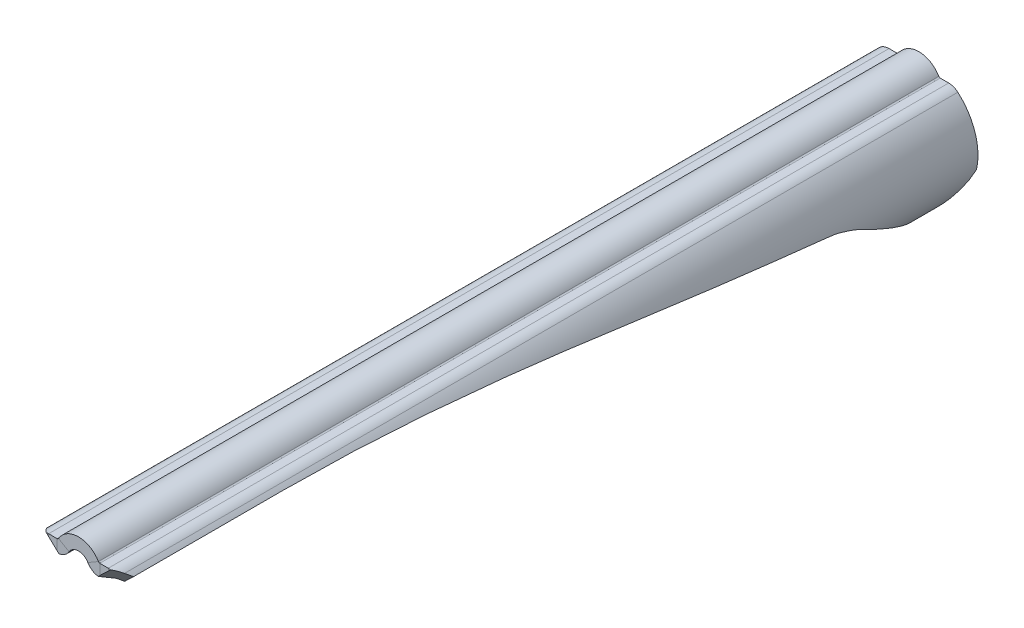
ISO-10303-21;
HEADER;
FILE_DESCRIPTION(('STEP AP214'),'2;1');
FILE_NAME('part.step','',(''),(''),'','','');
FILE_SCHEMA(('AUTOMOTIVE_DESIGN { 1 0 10303 214 1 1 1 1 }'));
ENDSEC;
DATA;
#1=APPLICATION_CONTEXT('core data for automotive mechanical design processes');
#2=APPLICATION_PROTOCOL_DEFINITION('international standard','automotive_design',2000,#1);
#3=PRODUCT_CONTEXT('',#1,'mechanical');
#4=PRODUCT('Part','Part','',(#3));
#5=PRODUCT_RELATED_PRODUCT_CATEGORY('part','',(#4));
#6=PRODUCT_DEFINITION_FORMATION('','',#4);
#7=PRODUCT_DEFINITION_CONTEXT('part definition',#1,'design');
#8=PRODUCT_DEFINITION('design','',#6,#7);
#9=PRODUCT_DEFINITION_SHAPE('','',#8);
#10=(LENGTH_UNIT() NAMED_UNIT(*) SI_UNIT(.MILLI.,.METRE.));
#11=(NAMED_UNIT(*) PLANE_ANGLE_UNIT() SI_UNIT($,.RADIAN.));
#12=(NAMED_UNIT(*) SI_UNIT($,.STERADIAN.) SOLID_ANGLE_UNIT());
#13=UNCERTAINTY_MEASURE_WITH_UNIT(LENGTH_MEASURE(1.E-05),#10,'distance_accuracy_value','');
#14=(GEOMETRIC_REPRESENTATION_CONTEXT(3) GLOBAL_UNCERTAINTY_ASSIGNED_CONTEXT((#13)) GLOBAL_UNIT_ASSIGNED_CONTEXT((#10,
#11,#12)) REPRESENTATION_CONTEXT('',''));
#15=CARTESIAN_POINT('',(0.,0.,0.));
#16=DIRECTION('',(0.,0.,1.));
#17=DIRECTION('',(1.,0.,0.));
#18=AXIS2_PLACEMENT_3D('',#15,#16,#17);
#19=CARTESIAN_POINT('',(0.,0.,103.));
#20=DIRECTION('',(0.,0.,-1.));
#21=DIRECTION('',(-1.,0.,0.));
#22=AXIS2_PLACEMENT_3D('',#19,#20,#21);
#23=CYLINDRICAL_SURFACE('',#22,5.75);
#24=CARTESIAN_POINT('',(0.,0.,0.));
#25=DIRECTION('',(0.,0.,1.));
#26=DIRECTION('',(1.,0.,0.));
#27=AXIS2_PLACEMENT_3D('',#24,#25,#26);
#28=CIRCLE('',#27,5.75);
#29=CARTESIAN_POINT('',(5.74529511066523,-0.232559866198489,0.));
#30=VERTEX_POINT('',#29);
#31=CARTESIAN_POINT('',(3.79010504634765,4.32407258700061,0.));
#32=VERTEX_POINT('',#31);
#33=EDGE_CURVE('E475',#30,#32,#28,.T.);
#34=ORIENTED_EDGE('',*,*,#33,.F.);
#35=CARTESIAN_POINT('',(0.,0.,3.));
#36=DIRECTION('',(-0.43448275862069,-0.413793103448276,-0.8));
#37=DIRECTION('',(0.579310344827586,0.551724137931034,-0.6));
#38=AXIS2_PLACEMENT_3D('',#35,#36,#37);
#39=ELLIPSE('',#38,7.1875,5.75);
#40=CARTESIAN_POINT('',(3.96551724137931,-4.16379310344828,3.));
#41=VERTEX_POINT('',#40);
#42=EDGE_CURVE('E309',#30,#41,#39,.T.);
#43=ORIENTED_EDGE('',*,*,#42,.T.);
#44=DIRECTION('',(0.,0.,-1.));
#45=VECTOR('',#44,1.);
#46=CARTESIAN_POINT('',(3.96551724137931,-4.16379310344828,103.));
#47=LINE('',#46,#45);
#48=CARTESIAN_POINT('',(3.96551724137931,-4.16379310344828,5.99999999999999));
#49=VERTEX_POINT('',#48);
#50=EDGE_CURVE('E302',#49,#41,#47,.T.);
#51=ORIENTED_EDGE('',*,*,#50,.F.);
#52=CARTESIAN_POINT('',(0.,0.,15.680773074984));
#53=DIRECTION('',(0.,0.918632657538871,-0.395112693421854));
#54=DIRECTION('',(0.,-0.395112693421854,-0.918632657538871));
#55=AXIS2_PLACEMENT_3D('',#52,#53,#54);
#56=ELLIPSE('',#55,14.5528101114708,5.75);
#57=CARTESIAN_POINT('',(5.71186571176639,-0.661127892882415,14.1436580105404));
#58=VERTEX_POINT('',#57);
#59=EDGE_CURVE('E285',#58,#49,#56,.T.);
#60=ORIENTED_EDGE('',*,*,#59,.F.);
#61=CARTESIAN_POINT('',(5.74999999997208,-2.07825613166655E-05,16.1949114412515));
#62=CARTESIAN_POINT('',(5.74999547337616,-0.0273733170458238,16.0727058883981));
#63=CARTESIAN_POINT('',(5.74980443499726,-0.0566222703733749,15.950921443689));
#64=CARTESIAN_POINT('',(5.74885547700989,-0.118934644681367,15.7083236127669));
#65=CARTESIAN_POINT('',(5.74809750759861,-0.151998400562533,15.587510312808));
#66=CARTESIAN_POINT('',(5.74589525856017,-0.219668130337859,15.3548745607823));
#67=CARTESIAN_POINT('',(5.74449913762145,-0.254031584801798,15.2429811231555));
#68=CARTESIAN_POINT('',(5.74085785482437,-0.326119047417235,15.020302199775));
#69=CARTESIAN_POINT('',(5.73861274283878,-0.363842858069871,14.9095166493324));
#70=CARTESIAN_POINT('',(5.73306048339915,-0.442825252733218,14.688733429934));
#71=CARTESIAN_POINT('',(5.72974908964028,-0.484097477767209,14.5787407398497));
#72=CARTESIAN_POINT('',(5.72183443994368,-0.570053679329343,14.3601292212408));
#73=CARTESIAN_POINT('',(5.71723102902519,-0.614738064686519,14.251510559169));
#74=CARTESIAN_POINT('',(5.71186571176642,-0.661127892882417,14.1436580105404));
#75=B_SPLINE_CURVE_WITH_KNOTS('',3,(#61,#62,#63,#64,#65,#66,#67,#68,#69,#70,#71,#72,#73,#74),
.UNSPECIFIED.,.F.,.F.,(4,2,2,2,2,2,4),(0.,0.375677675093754,0.751388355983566,1.10251223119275,
1.45361548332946,1.80613461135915,2.15869604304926),.UNSPECIFIED.);
#76=CARTESIAN_POINT('',(5.75000331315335,-8.37118091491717E-06,16.1949574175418));
#77=VERTEX_POINT('',#76);
#78=EDGE_CURVE('E295',#77,#58,#75,.T.);
#79=ORIENTED_EDGE('',*,*,#78,.F.);
#80=CARTESIAN_POINT('',(5.73974099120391,0.343326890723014,18.1048785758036));
#81=CARTESIAN_POINT('',(5.74013111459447,0.336786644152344,18.0239889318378));
#82=CARTESIAN_POINT('',(5.74057056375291,0.329269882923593,17.9431782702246));
#83=CARTESIAN_POINT('',(5.74151962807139,0.312294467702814,17.7819064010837));
#84=CARTESIAN_POINT('',(5.74202911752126,0.30283927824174,17.7014448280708));
#85=CARTESIAN_POINT('',(5.74309072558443,0.281987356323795,17.540870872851));
#86=CARTESIAN_POINT('',(5.74364279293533,0.270592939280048,17.4607581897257));
#87=CARTESIAN_POINT('',(5.74475452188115,0.245863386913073,17.3008817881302));
#88=CARTESIAN_POINT('',(5.74531417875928,0.232529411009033,17.2211178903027));
#89=CARTESIAN_POINT('',(5.74640072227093,0.203920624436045,17.0619382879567));
#90=CARTESIAN_POINT('',(5.74692760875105,0.188645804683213,16.9825225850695));
#91=CARTESIAN_POINT('',(5.74790219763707,0.15615518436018,16.8240397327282));
#92=CARTESIAN_POINT('',(5.74834985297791,0.138938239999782,16.744972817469));
#93=CARTESIAN_POINT('',(5.74911409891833,0.102562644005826,16.587187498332));
#94=CARTESIAN_POINT('',(5.74943053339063,0.0834017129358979,16.5084696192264));
#95=CARTESIAN_POINT('',(5.74987324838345,0.0431388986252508,16.3513817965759));
#96=CARTESIAN_POINT('',(5.74999918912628,0.0220336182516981,16.2730127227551));
#97=CARTESIAN_POINT('',(5.74999999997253,-1.77750008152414E-05,16.1949108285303));
#98=B_SPLINE_CURVE_WITH_KNOTS('',3,(#80,#81,#82,#83,#84,#85,#86,#87,#88,#89,#90,#91,#92,#93,#94,
#95,#96,#97),.UNSPECIFIED.,.F.,.F.,(4,2,2,2,2,2,2,2,4),(0.,0.243458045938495,0.486484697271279,
0.729223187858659,0.971817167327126,1.21441228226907,1.45715102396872,1.70017775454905,
1.94363745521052),.UNSPECIFIED.);
#99=CARTESIAN_POINT('',(5.73974099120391,0.343326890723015,18.1048785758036));
#100=VERTEX_POINT('',#99);
#101=EDGE_CURVE('E1359',#100,#77,#98,.T.);
#102=ORIENTED_EDGE('',*,*,#101,.F.);
#103=CARTESIAN_POINT('',(0.,0.,13.8590809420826));
#104=DIRECTION('',(0.,0.996746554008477,-0.0805996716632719));
#105=DIRECTION('',(0.,-0.0805996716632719,-0.996746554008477));
#106=AXIS2_PLACEMENT_3D('',#103,#104,#105);
#107=ELLIPSE('',#106,71.3402409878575,5.75);
#108=CARTESIAN_POINT('',(5.24922274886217,2.34694706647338,42.8829138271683));
#109=VERTEX_POINT('',#108);
#110=EDGE_CURVE('E1373',#109,#100,#107,.T.);
#111=ORIENTED_EDGE('',*,*,#110,.F.);
#112=CARTESIAN_POINT('',(4.15601326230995,3.97367006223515,83.1827496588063));
#113=CARTESIAN_POINT('',(4.15601351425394,3.97367106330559,82.6800872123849));
#114=CARTESIAN_POINT('',(4.15674640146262,3.97290474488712,82.1774265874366));
#115=CARTESIAN_POINT('',(4.15965995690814,3.96985203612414,81.1721095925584));
#116=CARTESIAN_POINT('',(4.16184063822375,3.96756563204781,80.669453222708));
#117=CARTESIAN_POINT('',(4.17632133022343,3.95236821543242,78.1559357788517));
#118=CARTESIAN_POINT('',(4.19935160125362,3.92816267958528,76.1451793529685));
#119=CARTESIAN_POINT('',(4.26622016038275,3.85541585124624,72.124440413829));
#120=CARTESIAN_POINT('',(4.31005885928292,3.80687407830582,70.1144579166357));
#121=CARTESIAN_POINT('',(4.41664512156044,3.68276214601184,66.0008274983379));
#122=CARTESIAN_POINT('',(4.4801874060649,3.60602455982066,63.8972357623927));
#123=CARTESIAN_POINT('',(4.61931941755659,3.42597199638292,59.6915940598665));
#124=CARTESIAN_POINT('',(4.69490919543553,3.32265690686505,57.589544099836));
#125=CARTESIAN_POINT('',(4.85155267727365,3.08944615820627,53.3856727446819));
#126=CARTESIAN_POINT('',(4.93261011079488,2.95953223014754,51.2838525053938));
#127=CARTESIAN_POINT('',(5.0934974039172,2.67315523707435,47.0820181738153));
#128=CARTESIAN_POINT('',(5.1733272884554,2.51669271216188,44.9820040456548));
#129=CARTESIAN_POINT('',(5.24922274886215,2.3469470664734,42.8829138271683));
#130=B_SPLINE_CURVE_WITH_KNOTS('',3,(#112,#113,#114,#115,#116,#117,#118,#119,#120,#121,#122,
#123,#124,#125,#126,#127,#128,#129),.UNSPECIFIED.,.F.,.F.,(4,2,2,2,2,2,2,2,4),(0.,
1.50798262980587,3.01597888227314,9.04877531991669,15.0816908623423,21.3993144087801,
27.7169646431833,34.0389686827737,40.3608441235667),.UNSPECIFIED.);
#131=CARTESIAN_POINT('',(4.15601326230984,3.97367006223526,83.1827496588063));
#132=VERTEX_POINT('',#131);
#133=EDGE_CURVE('E1337',#132,#109,#130,.T.);
#134=ORIENTED_EDGE('',*,*,#133,.F.);
#135=DIRECTION('',(0.,0.,-1.));
#136=VECTOR('',#135,1.);
#137=CARTESIAN_POINT('',(4.15601326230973,3.97367006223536,103.));
#138=LINE('',#137,#136);
#139=CARTESIAN_POINT('',(4.15601326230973,3.97367006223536,101.5));
#140=VERTEX_POINT('',#139);
#141=EDGE_CURVE('E1375',#140,#132,#138,.T.);
#142=ORIENTED_EDGE('',*,*,#141,.F.);
#143=CARTESIAN_POINT('',(0.,0.,101.5));
#144=DIRECTION('',(-0.488662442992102,0.511086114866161,-0.70710678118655));
#145=DIRECTION('',(0.488662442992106,-0.511086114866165,-0.707106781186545));
#146=AXIS2_PLACEMENT_3D('',#143,#144,#145);
#147=ELLIPSE('',#146,8.13172798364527,5.75);
#148=CARTESIAN_POINT('',(3.79010504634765,4.32407258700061,102.006134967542));
#149=VERTEX_POINT('',#148);
#150=EDGE_CURVE('E381',#140,#149,#147,.F.);
#151=ORIENTED_EDGE('',*,*,#150,.T.);
#152=DIRECTION('',(0.,0.,-1.));
#153=VECTOR('',#152,1.);
#154=CARTESIAN_POINT('',(3.79010504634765,4.32407258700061,103.));
#155=LINE('',#154,#153);
#156=EDGE_CURVE('E310',#149,#32,#155,.T.);
#157=ORIENTED_EDGE('',*,*,#156,.T.);
#158=EDGE_LOOP('',(#34,#43,#51,#60,#79,#102,#111,#134,#142,#151,#157));
#159=FACE_BOUND('',#158,.T.);
#160=ADVANCED_FACE('F37',(#159),#23,.F.);
#161=CARTESIAN_POINT('',(5.,-5.25,103.));
#162=DIRECTION('',(-0.724137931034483,-0.689655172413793,0.));
#163=DIRECTION('',(0.689655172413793,-0.724137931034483,0.));
#164=AXIS2_PLACEMENT_3D('',#161,#162,#163);
#165=PLANE('',#164);
#166=ORIENTED_EDGE('',*,*,#50,.T.);
#167=DIRECTION('',(0.689655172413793,-0.724137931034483,0.));
#168=VECTOR('',#167,1.);
#169=CARTESIAN_POINT('',(5.,-5.25,3.));
#170=LINE('',#169,#168);
#171=CARTESIAN_POINT('',(5.,-5.25,3.));
#172=VERTEX_POINT('',#171);
#173=EDGE_CURVE('E423',#41,#172,#170,.T.);
#174=ORIENTED_EDGE('',*,*,#173,.T.);
#175=DIRECTION('',(0.,0.,-1.));
#176=VECTOR('',#175,1.);
#177=CARTESIAN_POINT('',(5.,-5.25,103.));
#178=LINE('',#177,#176);
#179=CARTESIAN_POINT('',(5.,-5.25,5.99999999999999));
#180=VERTEX_POINT('',#179);
#181=EDGE_CURVE('E305',#180,#172,#178,.T.);
#182=ORIENTED_EDGE('',*,*,#181,.F.);
#183=DIRECTION('',(0.689655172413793,-0.724137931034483,0.));
#184=VECTOR('',#183,1.);
#185=CARTESIAN_POINT('',(5.,-5.25,5.99999999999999));
#186=LINE('',#185,#184);
#187=EDGE_CURVE('E289',#180,#49,#186,.F.);
#188=ORIENTED_EDGE('',*,*,#187,.T.);
#189=EDGE_LOOP('',(#166,#174,#182,#188));
#190=FACE_BOUND('',#189,.T.);
#191=ADVANCED_FACE('F301',(#190),#165,.T.);
#192=CARTESIAN_POINT('',(0.,0.,103.));
#193=DIRECTION('',(0.,0.,-1.));
#194=DIRECTION('',(-1.,0.,0.));
#195=AXIS2_PLACEMENT_3D('',#192,#193,#194);
#196=CYLINDRICAL_SURFACE('',#195,7.25);
#197=ORIENTED_EDGE('',*,*,#181,.T.);
#198=CARTESIAN_POINT('',(0.,0.,3.));
#199=DIRECTION('',(-0.43448275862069,-0.413793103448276,-0.8));
#200=DIRECTION('',(0.579310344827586,0.551724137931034,-0.6));
#201=AXIS2_PLACEMENT_3D('',#198,#199,#200);
#202=ELLIPSE('',#201,9.06250000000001,7.25);
#203=CARTESIAN_POINT('',(7.06668504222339,-1.62001929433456,0.));
#204=VERTEX_POINT('',#203);
#205=EDGE_CURVE('E425',#172,#204,#202,.F.);
#206=ORIENTED_EDGE('',*,*,#205,.T.);
#207=CARTESIAN_POINT('',(0.,0.,0.));
#208=DIRECTION('',(0.,0.,1.));
#209=DIRECTION('',(1.,0.,0.));
#210=AXIS2_PLACEMENT_3D('',#207,#208,#209);
#211=CIRCLE('',#210,7.25);
#212=CARTESIAN_POINT('',(4.7788281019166,5.45209152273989,0.));
#213=VERTEX_POINT('',#212);
#214=EDGE_CURVE('E477',#204,#213,#211,.T.);
#215=ORIENTED_EDGE('',*,*,#214,.T.);
#216=DIRECTION('',(0.,0.,-1.));
#217=VECTOR('',#216,1.);
#218=CARTESIAN_POINT('',(4.7788281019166,5.45209152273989,103.));
#219=LINE('',#218,#217);
#220=CARTESIAN_POINT('',(4.7788281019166,5.45209152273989,102.138170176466));
#221=VERTEX_POINT('',#220);
#222=EDGE_CURVE('E315',#221,#213,#219,.T.);
#223=ORIENTED_EDGE('',*,*,#222,.F.);
#224=CARTESIAN_POINT('',(0.,0.,101.5));
#225=DIRECTION('',(-0.488662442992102,0.511086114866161,-0.70710678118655));
#226=DIRECTION('',(0.488662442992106,-0.511086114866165,-0.707106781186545));
#227=AXIS2_PLACEMENT_3D('',#224,#225,#226);
#228=ELLIPSE('',#227,10.2530483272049,7.25);
#229=CARTESIAN_POINT('',(5.24019063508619,5.01027964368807,101.5));
#230=VERTEX_POINT('',#229);
#231=EDGE_CURVE('E377',#221,#230,#228,.T.);
#232=ORIENTED_EDGE('',*,*,#231,.T.);
#233=DIRECTION('',(0.,0.,-1.));
#234=VECTOR('',#233,1.);
#235=CARTESIAN_POINT('',(5.24019063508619,5.01027964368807,103.));
#236=LINE('',#235,#234);
#237=CARTESIAN_POINT('',(5.24019063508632,5.01027964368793,83.1827496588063));
#238=VERTEX_POINT('',#237);
#239=EDGE_CURVE('E1393',#230,#238,#236,.T.);
#240=ORIENTED_EDGE('',*,*,#239,.T.);
#241=CARTESIAN_POINT('',(5.24019063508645,5.01027964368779,83.1827496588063));
#242=CARTESIAN_POINT('',(5.24018989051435,5.01027874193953,82.6800855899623));
#243=CARTESIAN_POINT('',(5.24111451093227,5.00931358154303,82.1774225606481));
#244=CARTESIAN_POINT('',(5.24478919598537,5.00546666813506,81.1721033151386));
#245=CARTESIAN_POINT('',(5.24753928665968,5.0025848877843,80.6694470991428));
#246=CARTESIAN_POINT('',(5.25849142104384,4.99108083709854,79.1612932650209));
#247=CARTESIAN_POINT('',(5.26939530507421,4.9795998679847,78.1558345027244));
#248=CARTESIAN_POINT('',(5.29810755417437,4.94903968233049,76.1451257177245));
#249=CARTESIAN_POINT('',(5.31591597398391,4.92996040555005,75.1398756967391));
#250=CARTESIAN_POINT('',(5.35806750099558,4.88411503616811,73.1296635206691));
#251=CARTESIAN_POINT('',(5.38241076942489,4.85734875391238,72.1247013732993));
#252=CARTESIAN_POINT('',(5.43698780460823,4.79617984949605,70.115169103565));
#253=CARTESIAN_POINT('',(5.46722158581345,4.76177720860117,69.1105989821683));
#254=CARTESIAN_POINT('',(5.53442251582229,4.68353025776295,67.0533914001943));
#255=CARTESIAN_POINT('',(5.5716444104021,4.63931008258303,66.0007765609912));
#256=CARTESIAN_POINT('',(5.65085904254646,4.54248801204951,63.8961150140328));
#257=CARTESIAN_POINT('',(5.69285178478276,4.48988610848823,62.8440683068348));
#258=CARTESIAN_POINT('',(5.82449483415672,4.31953494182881,59.6888384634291));
#259=CARTESIAN_POINT('',(5.91981025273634,4.18923990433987,57.5865572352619));
#260=CARTESIAN_POINT('',(6.1173283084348,3.89514598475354,53.3823734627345));
#261=CARTESIAN_POINT('',(6.21953835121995,3.73131067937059,51.2804738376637));
#262=CARTESIAN_POINT('',(6.42235840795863,3.3702698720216,47.0795364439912));
#263=CARTESIAN_POINT('',(6.52296847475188,3.17306547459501,44.9804985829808));
#264=CARTESIAN_POINT('',(6.61858520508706,2.95919412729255,42.8829138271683));
#265=B_SPLINE_CURVE_WITH_KNOTS('',3,(#241,#242,#243,#244,#245,#246,#247,#248,#249,#250,#251,
#252,#253,#254,#255,#256,#257,#258,#259,#260,#261,#262,#263,#264),.UNSPECIFIED.,.F.,.F.,(4,2,2,
2,2,2,2,2,2,2,2,4),(0.,1.5079884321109,3.01599837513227,6.03269035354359,9.04940624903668,
12.0661965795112,15.0829943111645,18.2455478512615,21.4081044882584,27.7331926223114,
34.0651863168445,40.3969704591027),.UNSPECIFIED.);
#266=CARTESIAN_POINT('',(6.61858520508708,2.9591941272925,42.8829138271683));
#267=VERTEX_POINT('',#266);
#268=EDGE_CURVE('E1324',#238,#267,#265,.T.);
#269=ORIENTED_EDGE('',*,*,#268,.T.);
#270=CARTESIAN_POINT('',(0.,0.,13.8590809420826));
#271=DIRECTION('',(0.,0.994842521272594,-0.101431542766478));
#272=DIRECTION('',(0.,-0.101431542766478,-0.994842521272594));
#273=AXIS2_PLACEMENT_3D('',#270,#271,#272);
#274=ELLIPSE('',#273,71.4767793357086,7.25);
#275=CARTESIAN_POINT('',(7.23706472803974,0.432890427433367,18.1048785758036));
#276=VERTEX_POINT('',#275);
#277=EDGE_CURVE('E1388',#267,#276,#274,.T.);
#278=ORIENTED_EDGE('',*,*,#277,.T.);
#279=CARTESIAN_POINT('',(7.23706472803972,0.432890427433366,18.1048785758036));
#280=CARTESIAN_POINT('',(7.23756117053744,0.42456841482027,18.0232408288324));
#281=CARTESIAN_POINT('',(7.23812065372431,0.414995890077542,17.9417310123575));
#282=CARTESIAN_POINT('',(7.23932773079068,0.393390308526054,17.7792660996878));
#283=CARTESIAN_POINT('',(7.2399750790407,0.381364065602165,17.6983100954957));
#284=CARTESIAN_POINT('',(7.24132181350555,0.354869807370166,17.5369496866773));
#285=CARTESIAN_POINT('',(7.2420211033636,0.340406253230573,17.4565445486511));
#286=CARTESIAN_POINT('',(7.24342665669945,0.30905751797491,17.2962823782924));
#287=CARTESIAN_POINT('',(7.24413291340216,0.292174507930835,17.2164249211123));
#288=CARTESIAN_POINT('',(7.24550122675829,0.256006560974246,17.0572591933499));
#289=CARTESIAN_POINT('',(7.24616328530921,0.236721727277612,16.9779508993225));
#290=CARTESIAN_POINT('',(7.2473853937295,0.195767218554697,16.8198733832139));
#291=CARTESIAN_POINT('',(7.24794534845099,0.174095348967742,16.7411047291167));
#292=CARTESIAN_POINT('',(7.24889936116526,0.128383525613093,16.5841014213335));
#293=CARTESIAN_POINT('',(7.24929311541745,0.104339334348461,16.5058680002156));
#294=CARTESIAN_POINT('',(7.2498434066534,0.0539013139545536,16.3499286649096));
#295=CARTESIAN_POINT('',(7.24999930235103,0.0275013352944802,16.2722247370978));
#296=CARTESIAN_POINT('',(7.24999999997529,-1.89309584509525E-05,16.194920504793));
#297=B_SPLINE_CURVE_WITH_KNOTS('',3,(#279,#280,#281,#282,#283,#284,#285,#286,#287,#288,#289,
#290,#291,#292,#293,#294,#295,#296),.UNSPECIFIED.,.F.,.F.,(4,2,2,2,2,2,2,2,4),(0.,
0.246177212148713,0.491679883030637,0.736737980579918,0.981577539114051,1.22640657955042,
1.47146261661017,1.71696458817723,1.96312729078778),.UNSPECIFIED.);
#298=CARTESIAN_POINT('',(7.25000417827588,-9.18941146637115E-06,16.1949623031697));
#299=VERTEX_POINT('',#298);
#300=EDGE_CURVE('E1336',#276,#299,#297,.T.);
#301=ORIENTED_EDGE('',*,*,#300,.T.);
#302=CARTESIAN_POINT('',(7.24999999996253,-2.33091574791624E-05,16.194921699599));
#303=CARTESIAN_POINT('',(7.24999577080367,-0.034385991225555,16.0731528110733));
#304=CARTESIAN_POINT('',(7.24975533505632,-0.0710611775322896,15.9520346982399));
#305=CARTESIAN_POINT('',(7.24857499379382,-0.148978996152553,15.711274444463));
#306=CARTESIAN_POINT('',(7.24763505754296,-0.190221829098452,15.5916323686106));
#307=CARTESIAN_POINT('',(7.24488610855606,-0.27543232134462,15.3588770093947));
#308=CARTESIAN_POINT('',(7.24311427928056,-0.319219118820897,15.2456970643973));
#309=CARTESIAN_POINT('',(7.23849344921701,-0.410875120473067,15.021029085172));
#310=CARTESIAN_POINT('',(7.23564449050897,-0.458744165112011,14.909540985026));
#311=CARTESIAN_POINT('',(7.22860934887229,-0.558782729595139,14.6877786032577));
#312=CARTESIAN_POINT('',(7.22441555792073,-0.610975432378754,14.5775150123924));
#313=CARTESIAN_POINT('',(7.21443076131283,-0.719331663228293,14.3590186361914));
#314=CARTESIAN_POINT('',(7.20863961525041,-0.775495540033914,14.2507860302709));
#315=CARTESIAN_POINT('',(7.20191763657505,-0.833596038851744,14.1436580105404));
#316=B_SPLINE_CURVE_WITH_KNOTS('',3,(#302,#303,#304,#305,#306,#307,#308,#309,#310,#311,#312,
#313,#314,#315),.UNSPECIFIED.,.F.,.F.,(4,2,2,2,2,2,4),(0.,0.379553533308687,0.759123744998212,
1.12314309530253,1.48714822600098,1.85325006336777,2.21938409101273),.UNSPECIFIED.);
#317=CARTESIAN_POINT('',(7.20191763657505,-0.833596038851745,14.1436580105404));
#318=VERTEX_POINT('',#317);
#319=EDGE_CURVE('E296',#299,#318,#316,.T.);
#320=ORIENTED_EDGE('',*,*,#319,.T.);
#321=CARTESIAN_POINT('',(0.,0.,15.680773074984));
#322=DIRECTION('',(0.,0.879054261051,-0.476721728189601));
#323=DIRECTION('',(0.,-0.476721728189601,-0.879054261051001));
#324=AXIS2_PLACEMENT_3D('',#321,#322,#323);
#325=ELLIPSE('',#324,15.20803347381,7.25);
#326=EDGE_CURVE('E419',#318,#180,#325,.T.);
#327=ORIENTED_EDGE('',*,*,#326,.T.);
#328=EDGE_LOOP('',(#197,#206,#215,#223,#232,#240,#269,#278,#301,#320,#327));
#329=FACE_BOUND('',#328,.T.);
#330=ADVANCED_FACE('F647',(#329),#196,.T.);
#331=CARTESIAN_POINT('',(0.,0.,103.));
#332=DIRECTION('',(0.,0.,-1.));
#333=DIRECTION('',(-1.,0.,0.));
#334=AXIS2_PLACEMENT_3D('',#331,#332,#333);
#335=CYLINDRICAL_SURFACE('',#334,7.25);
#336=CARTESIAN_POINT('',(0.,0.,0.));
#337=DIRECTION('',(0.,0.,1.));
#338=DIRECTION('',(1.,0.,0.));
#339=AXIS2_PLACEMENT_3D('',#336,#337,#338);
#340=CIRCLE('',#339,7.25);
#341=CARTESIAN_POINT('',(-4.7788281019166,5.45209152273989,0.));
#342=VERTEX_POINT('',#341);
#343=CARTESIAN_POINT('',(-7.0666850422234,-1.62001929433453,0.));
#344=VERTEX_POINT('',#343);
#345=EDGE_CURVE('E435',#342,#344,#340,.T.);
#346=ORIENTED_EDGE('',*,*,#345,.T.);
#347=CARTESIAN_POINT('',(0.,0.,3.00000000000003));
#348=DIRECTION('',(-0.434482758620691,0.413793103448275,0.8));
#349=DIRECTION('',(-0.579310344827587,0.551724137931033,-0.6));
#350=AXIS2_PLACEMENT_3D('',#347,#348,#349);
#351=ELLIPSE('',#350,9.06250000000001,7.25);
#352=CARTESIAN_POINT('',(-5.,-5.25,3.));
#353=VERTEX_POINT('',#352);
#354=EDGE_CURVE('E59',#344,#353,#351,.T.);
#355=ORIENTED_EDGE('',*,*,#354,.T.);
#356=DIRECTION('',(0.,0.,-1.));
#357=VECTOR('',#356,1.);
#358=CARTESIAN_POINT('',(-5.,-5.25,103.));
#359=LINE('',#358,#357);
#360=CARTESIAN_POINT('',(-5.,-5.25,5.99999999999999));
#361=VERTEX_POINT('',#360);
#362=EDGE_CURVE('E336',#361,#353,#359,.T.);
#363=ORIENTED_EDGE('',*,*,#362,.F.);
#364=CARTESIAN_POINT('',(0.,0.,15.680773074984));
#365=DIRECTION('',(0.,0.879054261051,-0.476721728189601));
#366=DIRECTION('',(0.,-0.476721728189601,-0.879054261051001));
#367=AXIS2_PLACEMENT_3D('',#364,#365,#366);
#368=ELLIPSE('',#367,15.20803347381,7.25);
#369=CARTESIAN_POINT('',(-7.20191763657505,-0.833596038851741,14.1436580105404));
#370=VERTEX_POINT('',#369);
#371=EDGE_CURVE('E1281',#361,#370,#368,.T.);
#372=ORIENTED_EDGE('',*,*,#371,.T.);
#373=CARTESIAN_POINT('',(-7.20191763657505,-0.833596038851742,14.1436580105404));
#374=CARTESIAN_POINT('',(-7.20895741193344,-0.772748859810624,14.255842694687));
#375=CARTESIAN_POINT('',(-7.21497800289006,-0.714007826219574,14.3692310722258));
#376=CARTESIAN_POINT('',(-7.22528080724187,-0.600878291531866,14.5982214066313));
#377=CARTESIAN_POINT('',(-7.22956320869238,-0.546489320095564,14.7138231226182));
#378=CARTESIAN_POINT('',(-7.23649384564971,-0.445076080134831,14.9406184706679));
#379=CARTESIAN_POINT('',(-7.2392193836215,-0.397810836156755,15.0517021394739));
#380=CARTESIAN_POINT('',(-7.24362383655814,-0.307350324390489,15.2755383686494));
#381=CARTESIAN_POINT('',(-7.24530272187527,-0.264155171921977,15.3882909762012));
#382=CARTESIAN_POINT('',(-7.24784212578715,-0.181661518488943,15.615929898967));
#383=CARTESIAN_POINT('',(-7.24869804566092,-0.142386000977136,15.7308245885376));
#384=CARTESIAN_POINT('',(-7.24977510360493,-0.0680334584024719,15.9619617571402));
#385=CARTESIAN_POINT('',(-7.24999627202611,-0.0329562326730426,16.0782041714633));
#386=CARTESIAN_POINT('',(-7.24999999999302,1.00574572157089E-05,16.1950399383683));
#387=B_SPLINE_CURVE_WITH_KNOTS('',3,(#373,#374,#375,#376,#377,#378,#379,#380,#381,#382,#383,
#384,#385,#386),.UNSPECIFIED.,.F.,.F.,(4,2,2,2,2,2,4),(0.,0.383423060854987,0.766804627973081,
1.12897559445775,1.49115681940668,1.85535034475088,2.21952645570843),.UNSPECIFIED.);
#388=CARTESIAN_POINT('',(-7.25000441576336,3.84616794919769E-05,16.1951406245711));
#389=VERTEX_POINT('',#388);
#390=EDGE_CURVE('E1222',#370,#389,#387,.T.);
#391=ORIENTED_EDGE('',*,*,#390,.T.);
#392=CARTESIAN_POINT('',(-7.24999999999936,-3.05781860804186E-06,16.1950446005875));
#393=CARTESIAN_POINT('',(-7.24999905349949,0.0274841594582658,16.2723496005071));
#394=CARTESIAN_POINT('',(-7.2498436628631,0.0538358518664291,16.3500583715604));
#395=CARTESIAN_POINT('',(-7.24929540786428,0.104171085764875,16.5060103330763));
#396=CARTESIAN_POINT('',(-7.24890317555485,0.128160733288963,16.5842515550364));
#397=CARTESIAN_POINT('',(-7.2479527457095,0.173780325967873,16.7412662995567));
#398=CARTESIAN_POINT('',(-7.24739484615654,0.195414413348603,16.8200386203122));
#399=CARTESIAN_POINT('',(-7.24617627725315,0.236321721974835,16.9781163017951));
#400=CARTESIAN_POINT('',(-7.24551570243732,0.25559708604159,17.0574211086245));
#401=CARTESIAN_POINT('',(-7.24414892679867,0.291777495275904,17.2165735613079));
#402=CARTESIAN_POINT('',(-7.24344272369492,0.308682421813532,17.2964212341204));
#403=CARTESIAN_POINT('',(-7.24203562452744,0.340098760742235,17.4566589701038));
#404=CARTESIAN_POINT('',(-7.24133473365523,0.354608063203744,17.5370494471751));
#405=CARTESIAN_POINT('',(-7.23998377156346,0.381200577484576,17.6983788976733));
#406=CARTESIAN_POINT('',(-7.23933379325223,0.393279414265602,17.7793185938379));
#407=CARTESIAN_POINT('',(-7.23812243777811,0.414966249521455,17.941753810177));
#408=CARTESIAN_POINT('',(-7.23756130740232,0.424567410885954,18.023250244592));
#409=CARTESIAN_POINT('',(-7.23706472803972,0.432890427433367,18.1048785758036));
#410=B_SPLINE_CURVE_WITH_KNOTS('',3,(#392,#393,#394,#395,#396,#397,#398,#399,#400,#401,#402,
#403,#404,#405,#406,#407,#408,#409),.UNSPECIFIED.,.F.,.F.,(4,2,2,2,2,2,2,2,4),(0.,
0.246130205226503,0.491606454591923,0.736643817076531,0.981456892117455,1.22628221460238,
1.47132202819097,1.7167990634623,1.96294641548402),.UNSPECIFIED.);
#411=CARTESIAN_POINT('',(-7.23706472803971,0.432890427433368,18.1048785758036));
#412=VERTEX_POINT('',#411);
#413=EDGE_CURVE('E1302',#389,#412,#410,.T.);
#414=ORIENTED_EDGE('',*,*,#413,.T.);
#415=CARTESIAN_POINT('',(0.,0.,13.8590809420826));
#416=DIRECTION('',(0.,0.994842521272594,-0.101431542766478));
#417=DIRECTION('',(0.,-0.101431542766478,-0.994842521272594));
#418=AXIS2_PLACEMENT_3D('',#415,#416,#417);
#419=ELLIPSE('',#418,71.4767793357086,7.25);
#420=CARTESIAN_POINT('',(-6.61858520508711,2.95919412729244,42.8829138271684));
#421=VERTEX_POINT('',#420);
#422=EDGE_CURVE('E1300',#412,#421,#419,.T.);
#423=ORIENTED_EDGE('',*,*,#422,.T.);
#424=CARTESIAN_POINT('',(-6.6185852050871,2.95919412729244,42.8829138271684));
#425=CARTESIAN_POINT('',(-6.59581262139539,3.01012750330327,43.3824697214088));
#426=CARTESIAN_POINT('',(-6.5727574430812,3.06011543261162,43.8821074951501));
#427=CARTESIAN_POINT('',(-6.52619464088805,3.15820060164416,44.881551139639));
#428=CARTESIAN_POINT('',(-6.50268701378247,3.20629782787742,45.3813570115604));
#429=CARTESIAN_POINT('',(-6.38428940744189,3.44207790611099,47.8810326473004));
#430=CARTESIAN_POINT('',(-6.28685349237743,3.61557313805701,49.8821425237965));
#431=CARTESIAN_POINT('',(-6.09378474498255,3.9322607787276,53.8868828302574));
#432=CARTESIAN_POINT('',(-5.99815196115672,4.0754523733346,55.8905133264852));
#433=CARTESIAN_POINT('',(-5.81156412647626,4.33767238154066,59.9970017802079));
#434=CARTESIAN_POINT('',(-5.72105818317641,4.45519946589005,62.0999776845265));
#435=CARTESIAN_POINT('',(-5.59895967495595,4.6063357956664,65.2561248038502));
#436=CARTESIAN_POINT('',(-5.56053724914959,4.65252182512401,66.3084429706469));
#437=CARTESIAN_POINT('',(-5.48914295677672,4.73654454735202,68.4136015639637));
#438=CARTESIAN_POINT('',(-5.45617109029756,4.77438123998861,69.4664419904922));
#439=CARTESIAN_POINT('',(-5.39649493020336,4.84173233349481,71.5740855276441));
#440=CARTESIAN_POINT('',(-5.36979972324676,4.87123468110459,72.628889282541));
#441=CARTESIAN_POINT('',(-5.32352508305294,4.92176305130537,74.7388551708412));
#442=CARTESIAN_POINT('',(-5.30394563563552,4.94278909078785,75.7940173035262));
#443=CARTESIAN_POINT('',(-5.27236328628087,4.97646942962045,77.9047053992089));
#444=CARTESIAN_POINT('',(-5.26036121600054,4.98912281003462,78.9602313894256));
#445=CARTESIAN_POINT('',(-5.24426391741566,5.00601854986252,81.0714204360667));
#446=CARTESIAN_POINT('',(-5.24016876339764,5.01026083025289,82.1270834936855));
#447=CARTESIAN_POINT('',(-5.24019063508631,5.01027964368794,83.1827496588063));
#448=B_SPLINE_CURVE_WITH_KNOTS('',3,(#424,#425,#426,#427,#428,#429,#430,#431,#432,#433,#434,
#435,#436,#437,#438,#439,#440,#441,#442,#443,#444,#445,#446,#447),.UNSPECIFIED.,.F.,.F.,(4,2,2,
2,2,2,2,2,2,2,2,4),(0.,1.5079812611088,3.01597328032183,9.04864426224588,15.0814772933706,
21.4057274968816,24.5677840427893,27.7298406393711,30.8964471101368,34.0630472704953,
37.2299949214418,40.3969723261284),.UNSPECIFIED.);
#449=CARTESIAN_POINT('',(-5.24019063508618,5.01027964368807,83.1827496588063));
#450=VERTEX_POINT('',#449);
#451=EDGE_CURVE('E1254',#421,#450,#448,.T.);
#452=ORIENTED_EDGE('',*,*,#451,.T.);
#453=DIRECTION('',(0.,0.,-1.));
#454=VECTOR('',#453,1.);
#455=CARTESIAN_POINT('',(-5.24019063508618,5.01027964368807,103.));
#456=LINE('',#455,#454);
#457=CARTESIAN_POINT('',(-5.24019063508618,5.01027964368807,101.5));
#458=VERTEX_POINT('',#457);
#459=EDGE_CURVE('E1260',#450,#458,#456,.F.);
#460=ORIENTED_EDGE('',*,*,#459,.T.);
#461=CARTESIAN_POINT('',(0.,0.,101.5));
#462=DIRECTION('',(-0.488662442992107,-0.511086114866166,0.707106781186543));
#463=DIRECTION('',(-0.488662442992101,-0.51108611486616,-0.707106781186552));
#464=AXIS2_PLACEMENT_3D('',#461,#462,#463);
#465=ELLIPSE('',#464,10.253048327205,7.25);
#466=CARTESIAN_POINT('',(-4.7788281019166,5.45209152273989,102.138170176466));
#467=VERTEX_POINT('',#466);
#468=EDGE_CURVE('E398',#458,#467,#465,.F.);
#469=ORIENTED_EDGE('',*,*,#468,.T.);
#470=DIRECTION('',(0.,0.,-1.));
#471=VECTOR('',#470,1.);
#472=CARTESIAN_POINT('',(-4.7788281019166,5.45209152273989,103.));
#473=LINE('',#472,#471);
#474=EDGE_CURVE('E442',#467,#342,#473,.T.);
#475=ORIENTED_EDGE('',*,*,#474,.T.);
#476=EDGE_LOOP('',(#346,#355,#363,#372,#391,#414,#423,#452,#460,#469,#475));
#477=FACE_BOUND('',#476,.T.);
#478=ADVANCED_FACE('F440',(#477),#335,.T.);
#479=CARTESIAN_POINT('',(-3.96551724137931,-4.16379310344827,103.));
#480=DIRECTION('',(0.724137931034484,-0.689655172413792,0.));
#481=DIRECTION('',(0.689655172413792,0.724137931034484,0.));
#482=AXIS2_PLACEMENT_3D('',#479,#480,#481);
#483=PLANE('',#482);
#484=ORIENTED_EDGE('',*,*,#362,.T.);
#485=DIRECTION('',(0.689655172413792,0.724137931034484,0.));
#486=VECTOR('',#485,1.);
#487=CARTESIAN_POINT('',(-3.96551724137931,-4.16379310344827,3.));
#488=LINE('',#487,#486);
#489=CARTESIAN_POINT('',(-3.96551724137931,-4.16379310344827,3.));
#490=VERTEX_POINT('',#489);
#491=EDGE_CURVE('E45',#353,#490,#488,.T.);
#492=ORIENTED_EDGE('',*,*,#491,.T.);
#493=DIRECTION('',(0.,0.,-1.));
#494=VECTOR('',#493,1.);
#495=CARTESIAN_POINT('',(-3.96551724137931,-4.16379310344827,103.));
#496=LINE('',#495,#494);
#497=CARTESIAN_POINT('',(-3.96551724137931,-4.16379310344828,5.99999999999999));
#498=VERTEX_POINT('',#497);
#499=EDGE_CURVE('E334',#498,#490,#496,.T.);
#500=ORIENTED_EDGE('',*,*,#499,.F.);
#501=DIRECTION('',(-0.689655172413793,-0.724137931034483,0.));
#502=VECTOR('',#501,1.);
#503=CARTESIAN_POINT('',(-5.,-5.25,5.99999999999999));
#504=LINE('',#503,#502);
#505=EDGE_CURVE('E1280',#361,#498,#504,.F.);
#506=ORIENTED_EDGE('',*,*,#505,.F.);
#507=EDGE_LOOP('',(#484,#492,#500,#506));
#508=FACE_BOUND('',#507,.T.);
#509=ADVANCED_FACE('F676',(#508),#483,.T.);
#510=CARTESIAN_POINT('',(0.,0.,103.));
#511=DIRECTION('',(0.,0.,-1.));
#512=DIRECTION('',(-1.,0.,0.));
#513=AXIS2_PLACEMENT_3D('',#510,#511,#512);
#514=CYLINDRICAL_SURFACE('',#513,5.75);
#515=ORIENTED_EDGE('',*,*,#499,.T.);
#516=CARTESIAN_POINT('',(0.,0.,3.00000000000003));
#517=DIRECTION('',(-0.434482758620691,0.413793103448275,0.8));
#518=DIRECTION('',(-0.579310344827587,0.551724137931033,-0.6));
#519=AXIS2_PLACEMENT_3D('',#516,#517,#518);
#520=ELLIPSE('',#519,7.1875,5.75);
#521=CARTESIAN_POINT('',(-5.74529511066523,-0.232559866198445,0.));
#522=VERTEX_POINT('',#521);
#523=EDGE_CURVE('E11',#490,#522,#520,.F.);
#524=ORIENTED_EDGE('',*,*,#523,.T.);
#525=CARTESIAN_POINT('',(0.,0.,0.));
#526=DIRECTION('',(0.,0.,1.));
#527=DIRECTION('',(1.,0.,0.));
#528=AXIS2_PLACEMENT_3D('',#525,#526,#527);
#529=CIRCLE('',#528,5.75);
#530=CARTESIAN_POINT('',(-3.79010504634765,4.3240725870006,0.));
#531=VERTEX_POINT('',#530);
#532=EDGE_CURVE('E437',#531,#522,#529,.T.);
#533=ORIENTED_EDGE('',*,*,#532,.F.);
#534=DIRECTION('',(0.,0.,-1.));
#535=VECTOR('',#534,1.);
#536=CARTESIAN_POINT('',(-3.79010504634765,4.3240725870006,103.));
#537=LINE('',#536,#535);
#538=CARTESIAN_POINT('',(-3.79010504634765,4.3240725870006,102.006134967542));
#539=VERTEX_POINT('',#538);
#540=EDGE_CURVE('E332',#539,#531,#537,.T.);
#541=ORIENTED_EDGE('',*,*,#540,.F.);
#542=CARTESIAN_POINT('',(0.,0.,101.5));
#543=DIRECTION('',(-0.488662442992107,-0.511086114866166,0.707106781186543));
#544=DIRECTION('',(-0.488662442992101,-0.51108611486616,-0.707106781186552));
#545=AXIS2_PLACEMENT_3D('',#542,#543,#544);
#546=ELLIPSE('',#545,8.13172798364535,5.75);
#547=CARTESIAN_POINT('',(-4.15601326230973,3.97367006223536,101.5));
#548=VERTEX_POINT('',#547);
#549=EDGE_CURVE('E414',#539,#548,#546,.T.);
#550=ORIENTED_EDGE('',*,*,#549,.T.);
#551=DIRECTION('',(0.,0.,-1.));
#552=VECTOR('',#551,1.);
#553=CARTESIAN_POINT('',(-4.15601326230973,3.97367006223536,103.));
#554=LINE('',#553,#552);
#555=CARTESIAN_POINT('',(-4.15601326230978,3.97367006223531,83.1827496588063));
#556=VERTEX_POINT('',#555);
#557=EDGE_CURVE('E1239',#556,#548,#554,.F.);
#558=ORIENTED_EDGE('',*,*,#557,.F.);
#559=CARTESIAN_POINT('',(-5.24922274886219,2.34694706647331,42.8829138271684));
#560=CARTESIAN_POINT('',(-5.21265549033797,2.42873237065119,43.8943263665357));
#561=CARTESIAN_POINT('',(-5.17517457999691,2.50743489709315,44.9059572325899));
#562=CARTESIAN_POINT('',(-5.06109934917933,2.73430789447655,47.9416463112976));
#563=CARTESIAN_POINT('',(-4.98287821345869,2.87322983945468,49.9663407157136));
#564=CARTESIAN_POINT('',(-4.82804202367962,3.12642382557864,54.0173590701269));
#565=CARTESIAN_POINT('',(-4.751426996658,3.24069545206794,56.0436830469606));
#566=CARTESIAN_POINT('',(-4.60353235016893,3.44770886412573,60.1599591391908));
#567=CARTESIAN_POINT('',(-4.53248806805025,3.53968388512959,62.2499588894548));
#568=CARTESIAN_POINT('',(-4.43673568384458,3.65792812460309,65.386001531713));
#569=CARTESIAN_POINT('',(-4.40662073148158,3.69405630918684,66.4315157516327));
#570=CARTESIAN_POINT('',(-4.35068696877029,3.75977236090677,68.5228671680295));
#571=CARTESIAN_POINT('',(-4.32486815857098,3.78936022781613,69.5687043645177));
#572=CARTESIAN_POINT('',(-4.27817096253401,3.84200386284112,71.6615935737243));
#573=CARTESIAN_POINT('',(-4.25729703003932,3.86505374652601,72.7086458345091));
#574=CARTESIAN_POINT('',(-4.22112221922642,3.90452841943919,74.8029710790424));
#575=CARTESIAN_POINT('',(-4.20582133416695,3.92095321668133,75.8502440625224));
#576=CARTESIAN_POINT('',(-4.18114418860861,3.9472619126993,77.9450134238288));
#577=CARTESIAN_POINT('',(-4.17176832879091,3.95714536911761,78.9925098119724));
#578=CARTESIAN_POINT('',(-4.15919444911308,3.97034220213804,81.0875867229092));
#579=CARTESIAN_POINT('',(-4.15599646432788,3.97365554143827,82.1351672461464));
#580=CARTESIAN_POINT('',(-4.15601326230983,3.97367006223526,83.1827496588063));
#581=B_SPLINE_CURVE_WITH_KNOTS('',3,(#559,#560,#561,#562,#563,#564,#565,#566,#567,#568,#569,
#570,#571,#572,#573,#574,#575,#576,#577,#578,#579,#580),.UNSPECIFIED.,.F.,.F.,(4,2,2,2,2,2,2,2,
2,2,4),(0.,3.04611914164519,9.13884037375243,15.2316640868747,21.5111315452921,24.6508222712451,
27.7905131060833,30.9330208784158,34.0755248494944,37.218241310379,40.36097561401),.UNSPECIFIED.);
#582=CARTESIAN_POINT('',(-5.24922274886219,2.34694706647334,42.8829138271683));
#583=VERTEX_POINT('',#582);
#584=EDGE_CURVE('E1234',#583,#556,#581,.T.);
#585=ORIENTED_EDGE('',*,*,#584,.F.);
#586=CARTESIAN_POINT('',(0.,0.,13.8590809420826));
#587=DIRECTION('',(0.,0.996746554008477,-0.0805996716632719));
#588=DIRECTION('',(0.,-0.0805996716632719,-0.996746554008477));
#589=AXIS2_PLACEMENT_3D('',#586,#587,#588);
#590=ELLIPSE('',#589,71.3402409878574,5.75);
#591=CARTESIAN_POINT('',(-5.73974099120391,0.343326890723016,18.1048785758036));
#592=VERTEX_POINT('',#591);
#593=EDGE_CURVE('E1261',#592,#583,#590,.T.);
#594=ORIENTED_EDGE('',*,*,#593,.F.);
#595=CARTESIAN_POINT('',(-5.74999999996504,2.0051897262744E-05,16.1951241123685));
#596=CARTESIAN_POINT('',(-5.7499988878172,0.0220425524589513,16.273221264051));
#597=CARTESIAN_POINT('',(-5.74987329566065,0.043106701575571,16.3515881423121));
#598=CARTESIAN_POINT('',(-5.74943215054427,0.0832825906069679,16.508673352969));
#599=CARTESIAN_POINT('',(-5.74911693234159,0.102397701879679,16.5873908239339));
#600=CARTESIAN_POINT('',(-5.74835556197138,0.138696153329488,16.7451724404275));
#601=CARTESIAN_POINT('',(-5.7479095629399,0.1558817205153,16.8242360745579));
#602=CARTESIAN_POINT('',(-5.74693781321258,0.188333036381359,16.9827076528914));
#603=CARTESIAN_POINT('',(-5.74641210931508,0.20359990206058,17.0621153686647));
#604=CARTESIAN_POINT('',(-5.74532677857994,0.232218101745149,17.2212750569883));
#605=CARTESIAN_POINT('',(-5.74476715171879,0.245569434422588,17.3010270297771));
#606=CARTESIAN_POINT('',(-5.74365417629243,0.270352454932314,17.4608765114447));
#607=CARTESIAN_POINT('',(-5.74310083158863,0.281783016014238,17.5409741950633));
#608=CARTESIAN_POINT('',(-5.74203588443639,0.302712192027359,17.7015171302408));
#609=CARTESIAN_POINT('',(-5.74152433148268,0.312208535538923,17.7819626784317));
#610=CARTESIAN_POINT('',(-5.74057192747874,0.329247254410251,17.9432042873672));
#611=CARTESIAN_POINT('',(-5.74013120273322,0.336786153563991,18.0240007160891));
#612=CARTESIAN_POINT('',(-5.73974099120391,0.343326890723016,18.1048785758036));
#613=B_SPLINE_CURVE_WITH_KNOTS('',3,(#595,#596,#597,#598,#599,#600,#601,#602,#603,#604,#605,
#606,#607,#608,#609,#610,#611,#612),.UNSPECIFIED.,.F.,.F.,(4,2,2,2,2,2,2,2,4),(0.,
0.243421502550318,0.486414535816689,0.729124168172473,0.971691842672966,1.21425968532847,
1.45696932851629,1.69996237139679,1.94338403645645),.UNSPECIFIED.);
#614=CARTESIAN_POINT('',(-5.75000350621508,3.78679327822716E-05,16.195181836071));
#615=VERTEX_POINT('',#614);
#616=EDGE_CURVE('E1267',#615,#592,#613,.T.);
#617=ORIENTED_EDGE('',*,*,#616,.F.);
#618=CARTESIAN_POINT('',(-5.71186571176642,-0.661127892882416,14.1436580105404));
#619=CARTESIAN_POINT('',(-5.71764145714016,-0.611183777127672,14.2597646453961));
#620=CARTESIAN_POINT('',(-5.72253650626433,-0.563200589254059,14.3767535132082));
#621=CARTESIAN_POINT('',(-5.73084948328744,-0.471182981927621,14.6123067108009));
#622=CARTESIAN_POINT('',(-5.7342676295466,-0.427147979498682,14.7308708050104));
#623=CARTESIAN_POINT('',(-5.73968817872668,-0.346382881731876,14.9599356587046));
#624=CARTESIAN_POINT('',(-5.7417815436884,-0.309350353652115,15.0703279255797));
#625=CARTESIAN_POINT('',(-5.74515535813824,-0.238628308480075,15.2921957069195));
#626=CARTESIAN_POINT('',(-5.74643576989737,-0.204938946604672,15.403671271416));
#627=CARTESIAN_POINT('',(-5.74836696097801,-0.140763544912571,15.6279952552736));
#628=CARTESIAN_POINT('',(-5.74901537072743,-0.110289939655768,15.7408472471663));
#629=CARTESIAN_POINT('',(-5.74983015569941,-0.0526565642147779,15.9673858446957));
#630=CARTESIAN_POINT('',(-5.74999657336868,-0.0254965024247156,16.0810723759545));
#631=CARTESIAN_POINT('',(-5.74999999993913,2.64575034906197E-05,16.1951225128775));
#632=B_SPLINE_CURVE_WITH_KNOTS('',3,(#618,#619,#620,#621,#622,#623,#624,#625,#626,#627,#628,
#629,#630,#631),.UNSPECIFIED.,.F.,.F.,(4,2,2,2,2,2,4),(0.,0.379546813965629,0.759037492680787,
1.10835257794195,1.45768387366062,1.80831993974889,2.15892512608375),.UNSPECIFIED.);
#633=CARTESIAN_POINT('',(-5.71186571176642,-0.661127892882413,14.1436580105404));
#634=VERTEX_POINT('',#633);
#635=EDGE_CURVE('E1221',#634,#615,#632,.T.);
#636=ORIENTED_EDGE('',*,*,#635,.F.);
#637=CARTESIAN_POINT('',(0.,0.,15.680773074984));
#638=DIRECTION('',(0.,0.918632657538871,-0.395112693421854));
#639=DIRECTION('',(0.,-0.395112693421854,-0.918632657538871));
#640=AXIS2_PLACEMENT_3D('',#637,#638,#639);
#641=ELLIPSE('',#640,14.5528101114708,5.75);
#642=EDGE_CURVE('E1278',#498,#634,#641,.T.);
#643=ORIENTED_EDGE('',*,*,#642,.F.);
#644=EDGE_LOOP('',(#515,#524,#533,#541,#550,#558,#585,#594,#617,#636,#643));
#645=FACE_BOUND('',#644,.T.);
#646=ADVANCED_FACE('F634',(#645),#514,.F.);
#647=CARTESIAN_POINT('',(4.7788281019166,5.45209152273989,103.));
#648=DIRECTION('',(0.,0.,1.));
#649=DIRECTION('',(1.,0.,0.));
#650=AXIS2_PLACEMENT_3D('',#647,#648,#649);
#651=PLANE('',#650);
#652=DIRECTION('',(0.,1.,0.));
#653=VECTOR('',#652,1.);
#654=CARTESIAN_POINT('',(3.65827530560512,4.37367006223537,103.));
#655=LINE('',#654,#653);
#656=CARTESIAN_POINT('',(3.65827530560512,5.57307631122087,103.));
#657=VERTEX_POINT('',#656);
#658=CARTESIAN_POINT('',(3.65827530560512,5.87367006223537,103.));
#659=VERTEX_POINT('',#658);
#660=EDGE_CURVE('E370',#657,#659,#655,.T.);
#661=ORIENTED_EDGE('',*,*,#660,.F.);
#662=DIRECTION('',(0.722784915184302,0.691073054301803,0.));
#663=VECTOR('',#662,1.);
#664=CARTESIAN_POINT('',(4.18324073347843,6.07500911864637,103.));
#665=LINE('',#664,#663);
#666=CARTESIAN_POINT('',(3.94685740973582,5.84899700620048,103.));
#667=VERTEX_POINT('',#666);
#668=EDGE_CURVE('E372',#657,#667,#665,.T.);
#669=ORIENTED_EDGE('',*,*,#668,.T.);
#670=CARTESIAN_POINT('',(3.65827530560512,4.17367006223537,103.));
#671=DIRECTION('',(0.,0.,1.));
#672=DIRECTION('',(1.,0.,0.));
#673=AXIS2_PLACEMENT_3D('',#670,#671,#672);
#674=CIRCLE('',#673,1.7);
#675=EDGE_CURVE('E1406',#667,#659,#674,.T.);
#676=ORIENTED_EDGE('',*,*,#675,.T.);
#677=EDGE_LOOP('',(#661,#669,#676));
#678=FACE_BOUND('',#677,.T.);
#679=ADVANCED_FACE('F675',(#678),#651,.T.);
#680=CARTESIAN_POINT('',(3.65827530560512,5.87367006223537,0.));
#681=DIRECTION('',(0.,0.,-1.));
#682=DIRECTION('',(-1.,0.,0.));
#683=AXIS2_PLACEMENT_3D('',#680,#681,#682);
#684=PLANE('',#683);
#685=DIRECTION('',(0.,-1.,0.));
#686=VECTOR('',#685,1.);
#687=CARTESIAN_POINT('',(3.65827530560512,5.87367006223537,0.));
#688=LINE('',#687,#686);
#689=CARTESIAN_POINT('',(3.65827530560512,5.87367006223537,0.));
#690=VERTEX_POINT('',#689);
#691=CARTESIAN_POINT('',(3.65827530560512,4.37367006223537,0.));
#692=VERTEX_POINT('',#691);
#693=EDGE_CURVE('E367',#690,#692,#688,.T.);
#694=ORIENTED_EDGE('',*,*,#693,.F.);
#695=CARTESIAN_POINT('',(3.65827530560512,4.17367006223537,0.));
#696=DIRECTION('',(0.,0.,1.));
#697=DIRECTION('',(1.,0.,0.));
#698=AXIS2_PLACEMENT_3D('',#695,#696,#697);
#699=CIRCLE('',#698,1.7);
#700=EDGE_CURVE('E479',#213,#690,#699,.T.);
#701=ORIENTED_EDGE('',*,*,#700,.F.);
#702=DIRECTION('',(0.659148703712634,0.752012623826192,0.));
#703=VECTOR('',#702,1.);
#704=CARTESIAN_POINT('',(3.79010504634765,4.32407258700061,0.));
#705=LINE('',#704,#703);
#706=EDGE_CURVE('E364',#32,#213,#705,.T.);
#707=ORIENTED_EDGE('',*,*,#706,.F.);
#708=CARTESIAN_POINT('',(3.65827530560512,4.17367006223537,0.));
#709=DIRECTION('',(0.,0.,1.));
#710=DIRECTION('',(1.,0.,0.));
#711=AXIS2_PLACEMENT_3D('',#708,#709,#710);
#712=CIRCLE('',#711,0.2);
#713=EDGE_CURVE('E472',#32,#692,#712,.T.);
#714=ORIENTED_EDGE('',*,*,#713,.T.);
#715=EDGE_LOOP('',(#694,#701,#707,#714));
#716=FACE_BOUND('',#715,.T.);
#717=ADVANCED_FACE('F535',(#716),#684,.T.);
#718=CARTESIAN_POINT('',(3.79010504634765,4.32407258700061,0.));
#719=DIRECTION('',(0.,0.,-1.));
#720=DIRECTION('',(-1.,0.,0.));
#721=AXIS2_PLACEMENT_3D('',#718,#719,#720);
#722=PLANE('',#721);
#723=DIRECTION('',(-1.,0.,0.));
#724=VECTOR('',#723,1.);
#725=CARTESIAN_POINT('',(2.5,5.87367006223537,0.));
#726=LINE('',#725,#724);
#727=CARTESIAN_POINT('',(2.61725046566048,5.87367006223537,0.));
#728=VERTEX_POINT('',#727);
#729=EDGE_CURVE('E482',#690,#728,#726,.T.);
#730=ORIENTED_EDGE('',*,*,#729,.F.);
#731=ORIENTED_EDGE('',*,*,#693,.T.);
#732=DIRECTION('',(-1.,0.,0.));
#733=VECTOR('',#732,1.);
#734=CARTESIAN_POINT('',(2.5,4.37367006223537,0.));
#735=LINE('',#734,#733);
#736=CARTESIAN_POINT('',(2.61725046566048,4.37367006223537,0.));
#737=VERTEX_POINT('',#736);
#738=EDGE_CURVE('E469',#692,#737,#735,.T.);
#739=ORIENTED_EDGE('',*,*,#738,.T.);
#740=DIRECTION('',(0.,1.,0.));
#741=VECTOR('',#740,1.);
#742=CARTESIAN_POINT('',(2.61725046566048,4.37367006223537,0.));
#743=LINE('',#742,#741);
#744=EDGE_CURVE('E355',#737,#728,#743,.T.);
#745=ORIENTED_EDGE('',*,*,#744,.T.);
#746=EDGE_LOOP('',(#730,#731,#739,#745));
#747=FACE_BOUND('',#746,.T.);
#748=ADVANCED_FACE('F539',(#747),#722,.T.);
#749=CARTESIAN_POINT('',(2.61725046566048,5.87367006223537,103.));
#750=DIRECTION('',(0.,0.,1.));
#751=DIRECTION('',(1.,0.,0.));
#752=AXIS2_PLACEMENT_3D('',#749,#750,#751);
#753=PLANE('',#752);
#754=CARTESIAN_POINT('',(2.61725046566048,6.07367006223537,103.));
#755=DIRECTION('',(0.,0.,1.));
#756=DIRECTION('',(1.,0.,0.));
#757=AXIS2_PLACEMENT_3D('',#754,#755,#756);
#758=CIRCLE('',#757,1.7);
#759=CARTESIAN_POINT('',(2.41629676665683,4.38558901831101,103.));
#760=VERTEX_POINT('',#759);
#761=CARTESIAN_POINT('',(1.15043976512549,5.21432940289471,103.));
#762=VERTEX_POINT('',#761);
#763=EDGE_CURVE('E556',#760,#762,#758,.F.);
#764=ORIENTED_EDGE('',*,*,#763,.F.);
#765=DIRECTION('',(-0.722784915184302,-0.691073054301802,0.));
#766=VECTOR('',#765,1.);
#767=CARTESIAN_POINT('',(3.26457088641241,5.19664549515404,103.));
#768=LINE('',#767,#766);
#769=CARTESIAN_POINT('',(2.61725046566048,4.5777259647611,103.));
#770=VERTEX_POINT('',#769);
#771=EDGE_CURVE('E389',#760,#770,#768,.F.);
#772=ORIENTED_EDGE('',*,*,#771,.T.);
#773=DIRECTION('',(0.,-1.,0.));
#774=VECTOR('',#773,1.);
#775=CARTESIAN_POINT('',(2.61725046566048,5.87367006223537,103.));
#776=LINE('',#775,#774);
#777=CARTESIAN_POINT('',(2.61725046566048,5.87367006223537,103.));
#778=VERTEX_POINT('',#777);
#779=EDGE_CURVE('E361',#778,#770,#776,.T.);
#780=ORIENTED_EDGE('',*,*,#779,.F.);
#781=CARTESIAN_POINT('',(2.61725046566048,6.07367006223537,103.));
#782=DIRECTION('',(0.,0.,1.));
#783=DIRECTION('',(1.,0.,0.));
#784=AXIS2_PLACEMENT_3D('',#781,#782,#783);
#785=CIRCLE('',#784,0.2);
#786=CARTESIAN_POINT('',(2.44468450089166,5.97257116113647,103.));
#787=VERTEX_POINT('',#786);
#788=EDGE_CURVE('E581',#778,#787,#785,.F.);
#789=ORIENTED_EDGE('',*,*,#788,.T.);
#790=DIRECTION('',(0.862829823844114,0.505494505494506,0.));
#791=VECTOR('',#790,1.);
#792=CARTESIAN_POINT('',(1.15043976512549,5.21432940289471,103.));
#793=LINE('',#792,#791);
#794=EDGE_CURVE('E359',#762,#787,#793,.T.);
#795=ORIENTED_EDGE('',*,*,#794,.F.);
#796=EDGE_LOOP('',(#764,#772,#780,#789,#795));
#797=FACE_BOUND('',#796,.T.);
#798=ADVANCED_FACE('F709',(#797),#753,.T.);
#799=CARTESIAN_POINT('',(1.15043976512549,5.21432940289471,103.));
#800=DIRECTION('',(0.,0.,1.));
#801=DIRECTION('',(1.,0.,0.));
#802=AXIS2_PLACEMENT_3D('',#799,#800,#801);
#803=PLANE('',#802);
#804=ORIENTED_EDGE('',*,*,#779,.T.);
#805=DIRECTION('',(-0.722784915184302,-0.691073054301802,0.));
#806=VECTOR('',#805,1.);
#807=CARTESIAN_POINT('',(2.16894372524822,4.14908847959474,103.));
#808=LINE('',#807,#806);
#809=EDGE_CURVE('E391',#770,#657,#808,.F.);
#810=ORIENTED_EDGE('',*,*,#809,.T.);
#811=ORIENTED_EDGE('',*,*,#660,.T.);
#812=DIRECTION('',(-1.,0.,0.));
#813=VECTOR('',#812,1.);
#814=CARTESIAN_POINT('',(2.5,5.87367006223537,103.));
#815=LINE('',#814,#813);
#816=EDGE_CURVE('E587',#659,#778,#815,.T.);
#817=ORIENTED_EDGE('',*,*,#816,.T.);
#818=EDGE_LOOP('',(#804,#810,#811,#817));
#819=FACE_BOUND('',#818,.T.);
#820=ADVANCED_FACE('F706',(#819),#803,.T.);
#821=CARTESIAN_POINT('',(2.44468450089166,5.97257116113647,0.));
#822=DIRECTION('',(0.,0.,-1.));
#823=DIRECTION('',(-1.,0.,0.));
#824=AXIS2_PLACEMENT_3D('',#821,#822,#823);
#825=PLANE('',#824);
#826=DIRECTION('',(-0.862829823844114,-0.505494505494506,0.));
#827=VECTOR('',#826,1.);
#828=CARTESIAN_POINT('',(2.44468450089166,5.97257116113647,0.));
#829=LINE('',#828,#827);
#830=CARTESIAN_POINT('',(2.44468450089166,5.97257116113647,0.));
#831=VERTEX_POINT('',#830);
#832=CARTESIAN_POINT('',(1.15043976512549,5.21432940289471,0.));
#833=VERTEX_POINT('',#832);
#834=EDGE_CURVE('E357',#831,#833,#829,.T.);
#835=ORIENTED_EDGE('',*,*,#834,.F.);
#836=CARTESIAN_POINT('',(2.61725046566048,6.07367006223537,0.));
#837=DIRECTION('',(0.,0.,1.));
#838=DIRECTION('',(1.,0.,0.));
#839=AXIS2_PLACEMENT_3D('',#836,#837,#838);
#840=CIRCLE('',#839,0.2);
#841=EDGE_CURVE('E485',#728,#831,#840,.F.);
#842=ORIENTED_EDGE('',*,*,#841,.F.);
#843=ORIENTED_EDGE('',*,*,#744,.F.);
#844=CARTESIAN_POINT('',(2.61725046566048,6.07367006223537,0.));
#845=DIRECTION('',(0.,0.,1.));
#846=DIRECTION('',(1.,0.,0.));
#847=AXIS2_PLACEMENT_3D('',#844,#845,#846);
#848=CIRCLE('',#847,1.7);
#849=EDGE_CURVE('E466',#737,#833,#848,.F.);
#850=ORIENTED_EDGE('',*,*,#849,.T.);
#851=EDGE_LOOP('',(#835,#842,#843,#850));
#852=FACE_BOUND('',#851,.T.);
#853=ADVANCED_FACE('F551',(#852),#825,.T.);
#854=CARTESIAN_POINT('',(2.61725046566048,4.37367006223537,0.));
#855=DIRECTION('',(0.,0.,-1.));
#856=DIRECTION('',(-1.,0.,0.));
#857=AXIS2_PLACEMENT_3D('',#854,#855,#856);
#858=PLANE('',#857);
#859=CARTESIAN_POINT('',(0.,4.54033672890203,0.));
#860=DIRECTION('',(0.,0.,1.));
#861=DIRECTION('',(-1.,0.,0.));
#862=AXIS2_PLACEMENT_3D('',#859,#860,#861);
#863=CIRCLE('',#862,2.83333333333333);
#864=CARTESIAN_POINT('',(-2.44468450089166,5.97257116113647,0.));
#865=VERTEX_POINT('',#864);
#866=EDGE_CURVE('E488',#831,#865,#863,.T.);
#867=ORIENTED_EDGE('',*,*,#866,.F.);
#868=ORIENTED_EDGE('',*,*,#834,.T.);
#869=CARTESIAN_POINT('',(0.,4.54033672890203,0.));
#870=DIRECTION('',(0.,0.,1.));
#871=DIRECTION('',(1.,0.,0.));
#872=AXIS2_PLACEMENT_3D('',#869,#870,#871);
#873=CIRCLE('',#872,1.33333333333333);
#874=CARTESIAN_POINT('',(-1.15043976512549,5.21432940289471,0.));
#875=VERTEX_POINT('',#874);
#876=EDGE_CURVE('E463',#833,#875,#873,.T.);
#877=ORIENTED_EDGE('',*,*,#876,.T.);
#878=DIRECTION('',(-0.862829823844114,0.505494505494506,0.));
#879=VECTOR('',#878,1.);
#880=CARTESIAN_POINT('',(-1.15043976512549,5.21432940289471,0.));
#881=LINE('',#880,#879);
#882=EDGE_CURVE('E346',#875,#865,#881,.T.);
#883=ORIENTED_EDGE('',*,*,#882,.T.);
#884=EDGE_LOOP('',(#867,#868,#877,#883));
#885=FACE_BOUND('',#884,.T.);
#886=ADVANCED_FACE('F566',(#885),#858,.T.);
#887=CARTESIAN_POINT('',(-2.44468450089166,5.97257116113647,103.));
#888=DIRECTION('',(0.,0.,1.));
#889=DIRECTION('',(1.,0.,0.));
#890=AXIS2_PLACEMENT_3D('',#887,#888,#889);
#891=PLANE('',#890);
#892=DIRECTION('',(0.,1.,0.));
#893=VECTOR('',#892,1.);
#894=CARTESIAN_POINT('',(-2.61725046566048,4.37367006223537,103.));
#895=LINE('',#894,#893);
#896=CARTESIAN_POINT('',(-2.61725046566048,4.57772596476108,103.));
#897=VERTEX_POINT('',#896);
#898=CARTESIAN_POINT('',(-2.61725046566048,5.87367006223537,103.));
#899=VERTEX_POINT('',#898);
#900=EDGE_CURVE('E351',#897,#899,#895,.T.);
#901=ORIENTED_EDGE('',*,*,#900,.F.);
#902=DIRECTION('',(0.722784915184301,-0.691073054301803,0.));
#903=VECTOR('',#902,1.);
#904=CARTESIAN_POINT('',(-3.22382013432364,5.15768266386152,103.));
#905=LINE('',#904,#903);
#906=CARTESIAN_POINT('',(-2.41629676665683,4.38558901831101,103.));
#907=VERTEX_POINT('',#906);
#908=EDGE_CURVE('E406',#897,#907,#905,.T.);
#909=ORIENTED_EDGE('',*,*,#908,.T.);
#910=CARTESIAN_POINT('',(-2.61725046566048,6.07367006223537,103.));
#911=DIRECTION('',(0.,0.,1.));
#912=DIRECTION('',(1.,0.,0.));
#913=AXIS2_PLACEMENT_3D('',#910,#911,#912);
#914=CIRCLE('',#913,1.7);
#915=CARTESIAN_POINT('',(-1.15043976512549,5.21432940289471,103.));
#916=VERTEX_POINT('',#915);
#917=EDGE_CURVE('E500',#916,#907,#914,.F.);
#918=ORIENTED_EDGE('',*,*,#917,.F.);
#919=DIRECTION('',(0.862829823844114,-0.505494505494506,0.));
#920=VECTOR('',#919,1.);
#921=CARTESIAN_POINT('',(-2.44468450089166,5.97257116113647,103.));
#922=LINE('',#921,#920);
#923=CARTESIAN_POINT('',(-2.44468450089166,5.97257116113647,103.));
#924=VERTEX_POINT('',#923);
#925=EDGE_CURVE('E353',#924,#916,#922,.T.);
#926=ORIENTED_EDGE('',*,*,#925,.F.);
#927=CARTESIAN_POINT('',(-2.61725046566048,6.07367006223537,103.));
#928=DIRECTION('',(0.,0.,1.));
#929=DIRECTION('',(1.,0.,0.));
#930=AXIS2_PLACEMENT_3D('',#927,#928,#929);
#931=CIRCLE('',#930,0.2);
#932=EDGE_CURVE('E580',#924,#899,#931,.F.);
#933=ORIENTED_EDGE('',*,*,#932,.T.);
#934=EDGE_LOOP('',(#901,#909,#918,#926,#933));
#935=FACE_BOUND('',#934,.T.);
#936=ADVANCED_FACE('F616',(#935),#891,.T.);
#937=CARTESIAN_POINT('',(-2.61725046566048,4.37367006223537,103.));
#938=DIRECTION('',(0.,0.,1.));
#939=DIRECTION('',(1.,0.,0.));
#940=AXIS2_PLACEMENT_3D('',#937,#938,#939);
#941=PLANE('',#940);
#942=CARTESIAN_POINT('',(0.,4.54033672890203,103.));
#943=DIRECTION('',(0.,0.,1.));
#944=DIRECTION('',(-1.,0.,0.));
#945=AXIS2_PLACEMENT_3D('',#942,#943,#944);
#946=CIRCLE('',#945,2.83333333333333);
#947=EDGE_CURVE('E577',#787,#924,#946,.T.);
#948=ORIENTED_EDGE('',*,*,#947,.T.);
#949=ORIENTED_EDGE('',*,*,#925,.T.);
#950=CARTESIAN_POINT('',(0.,4.54033672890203,103.));
#951=DIRECTION('',(0.,0.,1.));
#952=DIRECTION('',(1.,0.,0.));
#953=AXIS2_PLACEMENT_3D('',#950,#951,#952);
#954=CIRCLE('',#953,1.33333333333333);
#955=EDGE_CURVE('E1407',#762,#916,#954,.T.);
#956=ORIENTED_EDGE('',*,*,#955,.F.);
#957=ORIENTED_EDGE('',*,*,#794,.T.);
#958=EDGE_LOOP('',(#948,#949,#956,#957));
#959=FACE_BOUND('',#958,.T.);
#960=ADVANCED_FACE('F696',(#959),#941,.T.);
#961=CARTESIAN_POINT('',(-2.61725046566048,5.87367006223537,0.));
#962=DIRECTION('',(0.,0.,-1.));
#963=DIRECTION('',(-1.,0.,0.));
#964=AXIS2_PLACEMENT_3D('',#961,#962,#963);
#965=PLANE('',#964);
#966=DIRECTION('',(0.,-1.,0.));
#967=VECTOR('',#966,1.);
#968=CARTESIAN_POINT('',(-2.61725046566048,5.87367006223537,0.));
#969=LINE('',#968,#967);
#970=CARTESIAN_POINT('',(-2.61725046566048,5.87367006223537,0.));
#971=VERTEX_POINT('',#970);
#972=CARTESIAN_POINT('',(-2.61725046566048,4.37367006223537,0.));
#973=VERTEX_POINT('',#972);
#974=EDGE_CURVE('E348',#971,#973,#969,.T.);
#975=ORIENTED_EDGE('',*,*,#974,.F.);
#976=CARTESIAN_POINT('',(-2.61725046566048,6.07367006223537,0.));
#977=DIRECTION('',(0.,0.,1.));
#978=DIRECTION('',(1.,0.,0.));
#979=AXIS2_PLACEMENT_3D('',#976,#977,#978);
#980=CIRCLE('',#979,0.2);
#981=EDGE_CURVE('E491',#865,#971,#980,.F.);
#982=ORIENTED_EDGE('',*,*,#981,.F.);
#983=ORIENTED_EDGE('',*,*,#882,.F.);
#984=CARTESIAN_POINT('',(-2.61725046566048,6.07367006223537,0.));
#985=DIRECTION('',(0.,0.,1.));
#986=DIRECTION('',(1.,0.,0.));
#987=AXIS2_PLACEMENT_3D('',#984,#985,#986);
#988=CIRCLE('',#987,1.7);
#989=EDGE_CURVE('E460',#875,#973,#988,.F.);
#990=ORIENTED_EDGE('',*,*,#989,.T.);
#991=EDGE_LOOP('',(#975,#982,#983,#990));
#992=FACE_BOUND('',#991,.T.);
#993=ADVANCED_FACE('F692',(#992),#965,.T.);
#994=CARTESIAN_POINT('',(-1.15043976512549,5.21432940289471,0.));
#995=DIRECTION('',(0.,0.,-1.));
#996=DIRECTION('',(-1.,0.,0.));
#997=AXIS2_PLACEMENT_3D('',#994,#995,#996);
#998=PLANE('',#997);
#999=DIRECTION('',(-1.,0.,0.));
#1000=VECTOR('',#999,1.);
#1001=CARTESIAN_POINT('',(-2.5,5.87367006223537,0.));
#1002=LINE('',#1001,#1000);
#1003=CARTESIAN_POINT('',(-3.65827530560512,5.87367006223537,0.));
#1004=VERTEX_POINT('',#1003);
#1005=EDGE_CURVE('E494',#971,#1004,#1002,.T.);
#1006=ORIENTED_EDGE('',*,*,#1005,.F.);
#1007=ORIENTED_EDGE('',*,*,#974,.T.);
#1008=DIRECTION('',(-1.,0.,0.));
#1009=VECTOR('',#1008,1.);
#1010=CARTESIAN_POINT('',(-2.5,4.37367006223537,0.));
#1011=LINE('',#1010,#1009);
#1012=CARTESIAN_POINT('',(-3.65827530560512,4.37367006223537,0.));
#1013=VERTEX_POINT('',#1012);
#1014=EDGE_CURVE('E457',#973,#1013,#1011,.T.);
#1015=ORIENTED_EDGE('',*,*,#1014,.T.);
#1016=DIRECTION('',(0.,1.,0.));
#1017=VECTOR('',#1016,1.);
#1018=CARTESIAN_POINT('',(-3.65827530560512,4.37367006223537,0.));
#1019=LINE('',#1018,#1017);
#1020=EDGE_CURVE('E338',#1013,#1004,#1019,.T.);
#1021=ORIENTED_EDGE('',*,*,#1020,.T.);
#1022=EDGE_LOOP('',(#1006,#1007,#1015,#1021));
#1023=FACE_BOUND('',#1022,.T.);
#1024=ADVANCED_FACE('F689',(#1023),#998,.T.);
#1025=CARTESIAN_POINT('',(-3.65827530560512,5.87367006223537,103.));
#1026=DIRECTION('',(0.,0.,1.));
#1027=DIRECTION('',(1.,0.,0.));
#1028=AXIS2_PLACEMENT_3D('',#1025,#1026,#1027);
#1029=PLANE('',#1028);
#1030=CARTESIAN_POINT('',(-3.65827530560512,4.17367006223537,103.));
#1031=DIRECTION('',(0.,0.,1.));
#1032=DIRECTION('',(1.,0.,0.));
#1033=AXIS2_PLACEMENT_3D('',#1030,#1031,#1032);
#1034=CIRCLE('',#1033,1.7);
#1035=CARTESIAN_POINT('',(-3.65827530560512,5.87367006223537,103.));
#1036=VERTEX_POINT('',#1035);
#1037=CARTESIAN_POINT('',(-3.94685740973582,5.84899700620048,103.));
#1038=VERTEX_POINT('',#1037);
#1039=EDGE_CURVE('E452',#1036,#1038,#1034,.T.);
#1040=ORIENTED_EDGE('',*,*,#1039,.T.);
#1041=DIRECTION('',(0.722784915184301,-0.691073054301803,0.));
#1042=VECTOR('',#1041,1.);
#1043=CARTESIAN_POINT('',(-3.80842103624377,5.71663446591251,103.));
#1044=LINE('',#1043,#1042);
#1045=CARTESIAN_POINT('',(-3.65827530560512,5.57307631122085,103.));
#1046=VERTEX_POINT('',#1045);
#1047=EDGE_CURVE('E402',#1038,#1046,#1044,.T.);
#1048=ORIENTED_EDGE('',*,*,#1047,.T.);
#1049=DIRECTION('',(0.,-1.,0.));
#1050=VECTOR('',#1049,1.);
#1051=CARTESIAN_POINT('',(-3.65827530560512,5.87367006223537,103.));
#1052=LINE('',#1051,#1050);
#1053=EDGE_CURVE('E343',#1036,#1046,#1052,.T.);
#1054=ORIENTED_EDGE('',*,*,#1053,.F.);
#1055=EDGE_LOOP('',(#1040,#1048,#1054));
#1056=FACE_BOUND('',#1055,.T.);
#1057=ADVANCED_FACE('F598',(#1056),#1029,.T.);
#1058=CARTESIAN_POINT('',(-3.79010504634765,4.3240725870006,103.));
#1059=DIRECTION('',(0.,0.,1.));
#1060=DIRECTION('',(1.,0.,0.));
#1061=AXIS2_PLACEMENT_3D('',#1058,#1059,#1060);
#1062=PLANE('',#1061);
#1063=ORIENTED_EDGE('',*,*,#1053,.T.);
#1064=DIRECTION('',(0.722784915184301,-0.691073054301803,0.));
#1065=VECTOR('',#1064,1.);
#1066=CARTESIAN_POINT('',(-3.10327170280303,5.04242324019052,103.));
#1067=LINE('',#1066,#1065);
#1068=EDGE_CURVE('E404',#1046,#897,#1067,.T.);
#1069=ORIENTED_EDGE('',*,*,#1068,.T.);
#1070=ORIENTED_EDGE('',*,*,#900,.T.);
#1071=DIRECTION('',(-1.,0.,0.));
#1072=VECTOR('',#1071,1.);
#1073=CARTESIAN_POINT('',(-2.5,5.87367006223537,103.));
#1074=LINE('',#1073,#1072);
#1075=EDGE_CURVE('E584',#899,#1036,#1074,.T.);
#1076=ORIENTED_EDGE('',*,*,#1075,.T.);
#1077=EDGE_LOOP('',(#1063,#1069,#1070,#1076));
#1078=FACE_BOUND('',#1077,.T.);
#1079=ADVANCED_FACE('F614',(#1078),#1062,.T.);
#1080=CARTESIAN_POINT('',(-4.7788281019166,5.45209152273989,0.));
#1081=DIRECTION('',(0.,0.,-1.));
#1082=DIRECTION('',(-1.,0.,0.));
#1083=AXIS2_PLACEMENT_3D('',#1080,#1081,#1082);
#1084=PLANE('',#1083);
#1085=DIRECTION('',(0.659148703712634,-0.752012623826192,0.));
#1086=VECTOR('',#1085,1.);
#1087=CARTESIAN_POINT('',(-4.7788281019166,5.45209152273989,0.));
#1088=LINE('',#1087,#1086);
#1089=EDGE_CURVE('E340',#342,#531,#1088,.T.);
#1090=ORIENTED_EDGE('',*,*,#1089,.F.);
#1091=CARTESIAN_POINT('',(-3.65827530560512,4.17367006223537,0.));
#1092=DIRECTION('',(0.,0.,1.));
#1093=DIRECTION('',(1.,0.,0.));
#1094=AXIS2_PLACEMENT_3D('',#1091,#1092,#1093);
#1095=CIRCLE('',#1094,1.7);
#1096=EDGE_CURVE('E497',#1004,#342,#1095,.T.);
#1097=ORIENTED_EDGE('',*,*,#1096,.F.);
#1098=ORIENTED_EDGE('',*,*,#1020,.F.);
#1099=CARTESIAN_POINT('',(-3.65827530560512,4.17367006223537,0.));
#1100=DIRECTION('',(0.,0.,1.));
#1101=DIRECTION('',(1.,0.,0.));
#1102=AXIS2_PLACEMENT_3D('',#1099,#1100,#1101);
#1103=CIRCLE('',#1102,0.2);
#1104=EDGE_CURVE('E446',#1013,#531,#1103,.T.);
#1105=ORIENTED_EDGE('',*,*,#1104,.T.);
#1106=EDGE_LOOP('',(#1090,#1097,#1098,#1105));
#1107=FACE_BOUND('',#1106,.T.);
#1108=ADVANCED_FACE('F630',(#1107),#1084,.T.);
#1109=CARTESIAN_POINT('',(-3.65827530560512,4.37367006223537,0.));
#1110=DIRECTION('',(0.,0.,-1.));
#1111=DIRECTION('',(-1.,0.,0.));
#1112=AXIS2_PLACEMENT_3D('',#1109,#1110,#1111);
#1113=PLANE('',#1112);
#1114=ORIENTED_EDGE('',*,*,#532,.T.);
#1115=DIRECTION('',(-0.689655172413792,-0.724137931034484,0.));
#1116=VECTOR('',#1115,1.);
#1117=CARTESIAN_POINT('',(-2.45228144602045,3.22510448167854,0.));
#1118=LINE('',#1117,#1116);
#1119=EDGE_CURVE('E427',#522,#344,#1118,.T.);
#1120=ORIENTED_EDGE('',*,*,#1119,.T.);
#1121=ORIENTED_EDGE('',*,*,#345,.F.);
#1122=ORIENTED_EDGE('',*,*,#1089,.T.);
#1123=EDGE_LOOP('',(#1114,#1120,#1121,#1122));
#1124=FACE_BOUND('',#1123,.T.);
#1125=ADVANCED_FACE('F434',(#1124),#1113,.T.);
#1126=CARTESIAN_POINT('',(-3.65827530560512,4.17367006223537,103.));
#1127=DIRECTION('',(0.,0.,-1.));
#1128=DIRECTION('',(-1.,0.,0.));
#1129=AXIS2_PLACEMENT_3D('',#1126,#1127,#1128);
#1130=CYLINDRICAL_SURFACE('',#1129,0.2);
#1131=DIRECTION('',(0.,0.,-1.));
#1132=VECTOR('',#1131,1.);
#1133=CARTESIAN_POINT('',(-3.65827530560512,4.37367006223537,103.));
#1134=LINE('',#1133,#1132);
#1135=CARTESIAN_POINT('',(-3.65827530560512,4.37367006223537,102.133087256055));
#1136=VERTEX_POINT('',#1135);
#1137=EDGE_CURVE('E330',#1136,#1013,#1134,.T.);
#1138=ORIENTED_EDGE('',*,*,#1137,.F.);
#1139=CARTESIAN_POINT('',(-3.65827530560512,4.17367006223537,101.988530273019));
#1140=DIRECTION('',(-0.488662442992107,-0.511086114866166,0.707106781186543));
#1141=DIRECTION('',(-0.488662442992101,-0.51108611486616,-0.707106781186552));
#1142=AXIS2_PLACEMENT_3D('',#1139,#1140,#1141);
#1143=ELLIPSE('',#1142,0.282842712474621,0.2);
#1144=EDGE_CURVE('E412',#1136,#539,#1143,.T.);
#1145=ORIENTED_EDGE('',*,*,#1144,.T.);
#1146=ORIENTED_EDGE('',*,*,#540,.T.);
#1147=ORIENTED_EDGE('',*,*,#1104,.F.);
#1148=EDGE_LOOP('',(#1138,#1145,#1146,#1147));
#1149=FACE_BOUND('',#1148,.T.);
#1150=ADVANCED_FACE('F668',(#1149),#1130,.F.);
#1151=CARTESIAN_POINT('',(-2.5,4.37367006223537,103.));
#1152=DIRECTION('',(0.,-1.,0.));
#1153=DIRECTION('',(1.,0.,0.));
#1154=AXIS2_PLACEMENT_3D('',#1151,#1152,#1153);
#1155=PLANE('',#1154);
#1156=DIRECTION('',(0.,0.,-1.));
#1157=VECTOR('',#1156,1.);
#1158=CARTESIAN_POINT('',(-2.61725046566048,4.37367006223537,103.));
#1159=LINE('',#1158,#1157);
#1160=CARTESIAN_POINT('',(-2.61725046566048,4.37367006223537,102.8525114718));
#1161=VERTEX_POINT('',#1160);
#1162=EDGE_CURVE('E328',#1161,#973,#1159,.T.);
#1163=ORIENTED_EDGE('',*,*,#1162,.F.);
#1164=DIRECTION('',(-0.822667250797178,0.,-0.56852316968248));
#1165=VECTOR('',#1164,1.);
#1166=CARTESIAN_POINT('',(-2.46891635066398,4.37367006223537,102.955021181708));
#1167=LINE('',#1166,#1165);
#1168=EDGE_CURVE('E410',#1161,#1136,#1167,.T.);
#1169=ORIENTED_EDGE('',*,*,#1168,.T.);
#1170=ORIENTED_EDGE('',*,*,#1137,.T.);
#1171=ORIENTED_EDGE('',*,*,#1014,.F.);
#1172=EDGE_LOOP('',(#1163,#1169,#1170,#1171));
#1173=FACE_BOUND('',#1172,.T.);
#1174=ADVANCED_FACE('F664',(#1173),#1155,.T.);
#1175=CARTESIAN_POINT('',(-2.61725046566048,6.07367006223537,103.));
#1176=DIRECTION('',(0.,0.,-1.));
#1177=DIRECTION('',(-1.,0.,0.));
#1178=AXIS2_PLACEMENT_3D('',#1175,#1176,#1177);
#1179=CYLINDRICAL_SURFACE('',#1178,1.7);
#1180=ORIENTED_EDGE('',*,*,#917,.T.);
#1181=CARTESIAN_POINT('',(-2.61725046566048,6.07367006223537,104.081245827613));
#1182=DIRECTION('',(-0.488662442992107,-0.511086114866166,0.707106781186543));
#1183=DIRECTION('',(-0.488662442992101,-0.51108611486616,-0.707106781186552));
#1184=AXIS2_PLACEMENT_3D('',#1181,#1182,#1183);
#1185=ELLIPSE('',#1184,2.40416305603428,1.7);
#1186=EDGE_CURVE('E408',#907,#1161,#1185,.F.);
#1187=ORIENTED_EDGE('',*,*,#1186,.T.);
#1188=ORIENTED_EDGE('',*,*,#1162,.T.);
#1189=ORIENTED_EDGE('',*,*,#989,.F.);
#1190=DIRECTION('',(0.,0.,-1.));
#1191=VECTOR('',#1190,1.);
#1192=CARTESIAN_POINT('',(-1.15043976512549,5.21432940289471,103.));
#1193=LINE('',#1192,#1191);
#1194=EDGE_CURVE('E325',#916,#875,#1193,.T.);
#1195=ORIENTED_EDGE('',*,*,#1194,.F.);
#1196=EDGE_LOOP('',(#1180,#1187,#1188,#1189,#1195));
#1197=FACE_BOUND('',#1196,.T.);
#1198=ADVANCED_FACE('F661',(#1197),#1179,.T.);
#1199=CARTESIAN_POINT('',(0.,4.54033672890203,103.));
#1200=DIRECTION('',(0.,0.,-1.));
#1201=DIRECTION('',(-1.,0.,0.));
#1202=AXIS2_PLACEMENT_3D('',#1199,#1200,#1201);
#1203=CYLINDRICAL_SURFACE('',#1202,1.33333333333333);
#1204=ORIENTED_EDGE('',*,*,#876,.F.);
#1205=DIRECTION('',(0.,0.,-1.));
#1206=VECTOR('',#1205,1.);
#1207=CARTESIAN_POINT('',(1.15043976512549,5.21432940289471,103.));
#1208=LINE('',#1207,#1206);
#1209=EDGE_CURVE('E322',#762,#833,#1208,.T.);
#1210=ORIENTED_EDGE('',*,*,#1209,.F.);
#1211=ORIENTED_EDGE('',*,*,#955,.T.);
#1212=ORIENTED_EDGE('',*,*,#1194,.T.);
#1213=EDGE_LOOP('',(#1204,#1210,#1211,#1212));
#1214=FACE_BOUND('',#1213,.T.);
#1215=ADVANCED_FACE('F561',(#1214),#1203,.F.);
#1216=CARTESIAN_POINT('',(2.61725046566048,6.07367006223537,103.));
#1217=DIRECTION('',(0.,0.,-1.));
#1218=DIRECTION('',(-1.,0.,0.));
#1219=AXIS2_PLACEMENT_3D('',#1216,#1217,#1218);
#1220=CYLINDRICAL_SURFACE('',#1219,1.7);
#1221=DIRECTION('',(0.,0.,-1.));
#1222=VECTOR('',#1221,1.);
#1223=CARTESIAN_POINT('',(2.61725046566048,4.37367006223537,103.));
#1224=LINE('',#1223,#1222);
#1225=CARTESIAN_POINT('',(2.61725046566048,4.37367006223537,102.8525114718));
#1226=VERTEX_POINT('',#1225);
#1227=EDGE_CURVE('E320',#1226,#737,#1224,.T.);
#1228=ORIENTED_EDGE('',*,*,#1227,.F.);
#1229=CARTESIAN_POINT('',(2.61725046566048,6.07367006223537,104.081245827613));
#1230=DIRECTION('',(-0.488662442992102,0.511086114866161,-0.70710678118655));
#1231=DIRECTION('',(0.488662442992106,-0.511086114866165,-0.707106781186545));
#1232=AXIS2_PLACEMENT_3D('',#1229,#1230,#1231);
#1233=ELLIPSE('',#1232,2.40416305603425,1.7);
#1234=EDGE_CURVE('E387',#1226,#760,#1233,.T.);
#1235=ORIENTED_EDGE('',*,*,#1234,.T.);
#1236=ORIENTED_EDGE('',*,*,#763,.T.);
#1237=ORIENTED_EDGE('',*,*,#1209,.T.);
#1238=ORIENTED_EDGE('',*,*,#849,.F.);
#1239=EDGE_LOOP('',(#1228,#1235,#1236,#1237,#1238));
#1240=FACE_BOUND('',#1239,.T.);
#1241=ADVANCED_FACE('F552',(#1240),#1220,.T.);
#1242=CARTESIAN_POINT('',(2.5,4.37367006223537,103.));
#1243=DIRECTION('',(0.,-1.,0.));
#1244=DIRECTION('',(1.,0.,0.));
#1245=AXIS2_PLACEMENT_3D('',#1242,#1243,#1244);
#1246=PLANE('',#1245);
#1247=DIRECTION('',(0.,0.,-1.));
#1248=VECTOR('',#1247,1.);
#1249=CARTESIAN_POINT('',(3.65827530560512,4.37367006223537,103.));
#1250=LINE('',#1249,#1248);
#1251=CARTESIAN_POINT('',(3.65827530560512,4.37367006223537,102.133087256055));
#1252=VERTEX_POINT('',#1251);
#1253=EDGE_CURVE('E313',#1252,#692,#1250,.T.);
#1254=ORIENTED_EDGE('',*,*,#1253,.F.);
#1255=DIRECTION('',(0.822667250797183,0.,-0.568523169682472));
#1256=VECTOR('',#1255,1.);
#1257=CARTESIAN_POINT('',(2.46891635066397,4.37367006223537,102.955021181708));
#1258=LINE('',#1257,#1256);
#1259=EDGE_CURVE('E385',#1252,#1226,#1258,.F.);
#1260=ORIENTED_EDGE('',*,*,#1259,.T.);
#1261=ORIENTED_EDGE('',*,*,#1227,.T.);
#1262=ORIENTED_EDGE('',*,*,#738,.F.);
#1263=EDGE_LOOP('',(#1254,#1260,#1261,#1262));
#1264=FACE_BOUND('',#1263,.T.);
#1265=ADVANCED_FACE('F542',(#1264),#1246,.T.);
#1266=CARTESIAN_POINT('',(3.65827530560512,4.17367006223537,103.));
#1267=DIRECTION('',(0.,0.,-1.));
#1268=DIRECTION('',(-1.,0.,0.));
#1269=AXIS2_PLACEMENT_3D('',#1266,#1267,#1268);
#1270=CYLINDRICAL_SURFACE('',#1269,0.2);
#1271=ORIENTED_EDGE('',*,*,#156,.F.);
#1272=CARTESIAN_POINT('',(3.65827530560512,4.17367006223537,101.988530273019));
#1273=DIRECTION('',(-0.488662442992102,0.511086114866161,-0.70710678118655));
#1274=DIRECTION('',(0.488662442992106,-0.511086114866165,-0.707106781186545));
#1275=AXIS2_PLACEMENT_3D('',#1272,#1273,#1274);
#1276=ELLIPSE('',#1275,0.282842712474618,0.2);
#1277=EDGE_CURVE('E383',#149,#1252,#1276,.F.);
#1278=ORIENTED_EDGE('',*,*,#1277,.T.);
#1279=ORIENTED_EDGE('',*,*,#1253,.T.);
#1280=ORIENTED_EDGE('',*,*,#713,.F.);
#1281=EDGE_LOOP('',(#1271,#1278,#1279,#1280));
#1282=FACE_BOUND('',#1281,.T.);
#1283=ADVANCED_FACE('F651',(#1282),#1270,.F.);
#1284=CARTESIAN_POINT('',(3.65827530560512,4.17367006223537,103.));
#1285=DIRECTION('',(0.,0.,-1.));
#1286=DIRECTION('',(-1.,0.,0.));
#1287=AXIS2_PLACEMENT_3D('',#1284,#1285,#1286);
#1288=CYLINDRICAL_SURFACE('',#1287,1.7);
#1289=ORIENTED_EDGE('',*,*,#675,.F.);
#1290=CARTESIAN_POINT('',(3.65827530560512,4.17367006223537,101.988530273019));
#1291=DIRECTION('',(-0.488662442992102,0.511086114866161,-0.70710678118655));
#1292=DIRECTION('',(0.488662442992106,-0.511086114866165,-0.707106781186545));
#1293=AXIS2_PLACEMENT_3D('',#1290,#1291,#1292);
#1294=ELLIPSE('',#1293,2.40416305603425,1.7);
#1295=EDGE_CURVE('E375',#667,#221,#1294,.T.);
#1296=ORIENTED_EDGE('',*,*,#1295,.T.);
#1297=ORIENTED_EDGE('',*,*,#222,.T.);
#1298=ORIENTED_EDGE('',*,*,#700,.T.);
#1299=DIRECTION('',(0.,0.,-1.));
#1300=VECTOR('',#1299,1.);
#1301=CARTESIAN_POINT('',(3.65827530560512,5.87367006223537,103.));
#1302=LINE('',#1301,#1300);
#1303=EDGE_CURVE('E517',#659,#690,#1302,.T.);
#1304=ORIENTED_EDGE('',*,*,#1303,.F.);
#1305=EDGE_LOOP('',(#1289,#1296,#1297,#1298,#1304));
#1306=FACE_BOUND('',#1305,.T.);
#1307=ADVANCED_FACE('F523',(#1306),#1288,.T.);
#1308=CARTESIAN_POINT('',(2.5,5.87367006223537,103.));
#1309=DIRECTION('',(0.,-1.,0.));
#1310=DIRECTION('',(1.,0.,0.));
#1311=AXIS2_PLACEMENT_3D('',#1308,#1309,#1310);
#1312=PLANE('',#1311);
#1313=ORIENTED_EDGE('',*,*,#729,.T.);
#1314=DIRECTION('',(0.,0.,-1.));
#1315=VECTOR('',#1314,1.);
#1316=CARTESIAN_POINT('',(2.61725046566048,5.87367006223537,103.));
#1317=LINE('',#1316,#1315);
#1318=EDGE_CURVE('E514',#778,#728,#1317,.T.);
#1319=ORIENTED_EDGE('',*,*,#1318,.F.);
#1320=ORIENTED_EDGE('',*,*,#816,.F.);
#1321=ORIENTED_EDGE('',*,*,#1303,.T.);
#1322=EDGE_LOOP('',(#1313,#1319,#1320,#1321));
#1323=FACE_BOUND('',#1322,.T.);
#1324=ADVANCED_FACE('F951',(#1323),#1312,.F.);
#1325=CARTESIAN_POINT('',(2.61725046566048,6.07367006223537,103.));
#1326=DIRECTION('',(0.,0.,-1.));
#1327=DIRECTION('',(-1.,0.,0.));
#1328=AXIS2_PLACEMENT_3D('',#1325,#1326,#1327);
#1329=CYLINDRICAL_SURFACE('',#1328,0.2);
#1330=ORIENTED_EDGE('',*,*,#841,.T.);
#1331=DIRECTION('',(0.,0.,-1.));
#1332=VECTOR('',#1331,1.);
#1333=CARTESIAN_POINT('',(2.44468450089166,5.97257116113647,103.));
#1334=LINE('',#1333,#1332);
#1335=EDGE_CURVE('E511',#787,#831,#1334,.T.);
#1336=ORIENTED_EDGE('',*,*,#1335,.F.);
#1337=ORIENTED_EDGE('',*,*,#788,.F.);
#1338=ORIENTED_EDGE('',*,*,#1318,.T.);
#1339=EDGE_LOOP('',(#1330,#1336,#1337,#1338));
#1340=FACE_BOUND('',#1339,.T.);
#1341=ADVANCED_FACE('F569',(#1340),#1329,.F.);
#1342=CARTESIAN_POINT('',(0.,4.54033672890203,103.));
#1343=DIRECTION('',(0.,0.,-1.));
#1344=DIRECTION('',(-1.,0.,0.));
#1345=AXIS2_PLACEMENT_3D('',#1342,#1343,#1344);
#1346=CYLINDRICAL_SURFACE('',#1345,2.83333333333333);
#1347=ORIENTED_EDGE('',*,*,#866,.T.);
#1348=DIRECTION('',(0.,0.,-1.));
#1349=VECTOR('',#1348,1.);
#1350=CARTESIAN_POINT('',(-2.44468450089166,5.97257116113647,103.));
#1351=LINE('',#1350,#1349);
#1352=EDGE_CURVE('E508',#924,#865,#1351,.T.);
#1353=ORIENTED_EDGE('',*,*,#1352,.F.);
#1354=ORIENTED_EDGE('',*,*,#947,.F.);
#1355=ORIENTED_EDGE('',*,*,#1335,.T.);
#1356=EDGE_LOOP('',(#1347,#1353,#1354,#1355));
#1357=FACE_BOUND('',#1356,.T.);
#1358=ADVANCED_FACE('F574',(#1357),#1346,.T.);
#1359=CARTESIAN_POINT('',(-2.61725046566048,6.07367006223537,103.));
#1360=DIRECTION('',(0.,0.,-1.));
#1361=DIRECTION('',(-1.,0.,0.));
#1362=AXIS2_PLACEMENT_3D('',#1359,#1360,#1361);
#1363=CYLINDRICAL_SURFACE('',#1362,0.2);
#1364=ORIENTED_EDGE('',*,*,#981,.T.);
#1365=DIRECTION('',(0.,0.,-1.));
#1366=VECTOR('',#1365,1.);
#1367=CARTESIAN_POINT('',(-2.61725046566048,5.87367006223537,103.));
#1368=LINE('',#1367,#1366);
#1369=EDGE_CURVE('E505',#899,#971,#1368,.T.);
#1370=ORIENTED_EDGE('',*,*,#1369,.F.);
#1371=ORIENTED_EDGE('',*,*,#932,.F.);
#1372=ORIENTED_EDGE('',*,*,#1352,.T.);
#1373=EDGE_LOOP('',(#1364,#1370,#1371,#1372));
#1374=FACE_BOUND('',#1373,.T.);
#1375=ADVANCED_FACE('F621',(#1374),#1363,.F.);
#1376=CARTESIAN_POINT('',(-2.5,5.87367006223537,103.));
#1377=DIRECTION('',(0.,-1.,0.));
#1378=DIRECTION('',(1.,0.,0.));
#1379=AXIS2_PLACEMENT_3D('',#1376,#1377,#1378);
#1380=PLANE('',#1379);
#1381=ORIENTED_EDGE('',*,*,#1005,.T.);
#1382=DIRECTION('',(0.,0.,-1.));
#1383=VECTOR('',#1382,1.);
#1384=CARTESIAN_POINT('',(-3.65827530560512,5.87367006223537,103.));
#1385=LINE('',#1384,#1383);
#1386=EDGE_CURVE('E502',#1036,#1004,#1385,.T.);
#1387=ORIENTED_EDGE('',*,*,#1386,.F.);
#1388=ORIENTED_EDGE('',*,*,#1075,.F.);
#1389=ORIENTED_EDGE('',*,*,#1369,.T.);
#1390=EDGE_LOOP('',(#1381,#1387,#1388,#1389));
#1391=FACE_BOUND('',#1390,.T.);
#1392=ADVANCED_FACE('F625',(#1391),#1380,.F.);
#1393=CARTESIAN_POINT('',(-3.65827530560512,4.17367006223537,103.));
#1394=DIRECTION('',(0.,0.,-1.));
#1395=DIRECTION('',(-1.,0.,0.));
#1396=AXIS2_PLACEMENT_3D('',#1393,#1394,#1395);
#1397=CYLINDRICAL_SURFACE('',#1396,1.7);
#1398=ORIENTED_EDGE('',*,*,#474,.F.);
#1399=CARTESIAN_POINT('',(-3.65827530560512,4.17367006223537,101.988530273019));
#1400=DIRECTION('',(-0.488662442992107,-0.511086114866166,0.707106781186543));
#1401=DIRECTION('',(-0.488662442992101,-0.51108611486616,-0.707106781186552));
#1402=AXIS2_PLACEMENT_3D('',#1399,#1400,#1401);
#1403=ELLIPSE('',#1402,2.40416305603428,1.7);
#1404=EDGE_CURVE('E400',#467,#1038,#1403,.F.);
#1405=ORIENTED_EDGE('',*,*,#1404,.T.);
#1406=ORIENTED_EDGE('',*,*,#1039,.F.);
#1407=ORIENTED_EDGE('',*,*,#1386,.T.);
#1408=ORIENTED_EDGE('',*,*,#1096,.T.);
#1409=EDGE_LOOP('',(#1398,#1405,#1406,#1407,#1408));
#1410=FACE_BOUND('',#1409,.T.);
#1411=ADVANCED_FACE('F627',(#1410),#1397,.T.);
#1412=CARTESIAN_POINT('',(0.,0.,0.));
#1413=DIRECTION('',(0.,0.,1.));
#1414=DIRECTION('',(1.,0.,0.));
#1415=AXIS2_PLACEMENT_3D('',#1412,#1413,#1414);
#1416=PLANE('',#1415);
#1417=ORIENTED_EDGE('',*,*,#214,.F.);
#1418=DIRECTION('',(-0.689655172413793,0.724137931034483,0.));
#1419=VECTOR('',#1418,1.);
#1420=CARTESIAN_POINT('',(6.86206896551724,-1.40517241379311,0.));
#1421=LINE('',#1420,#1419);
#1422=EDGE_CURVE('E416',#204,#30,#1421,.T.);
#1423=ORIENTED_EDGE('',*,*,#1422,.T.);
#1424=ORIENTED_EDGE('',*,*,#33,.T.);
#1425=ORIENTED_EDGE('',*,*,#706,.T.);
#1426=EDGE_LOOP('',(#1417,#1423,#1424,#1425));
#1427=FACE_BOUND('',#1426,.T.);
#1428=ADVANCED_FACE('F531',(#1427),#1416,.F.);
#1429=CARTESIAN_POINT('',(-5.69681618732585,-0.659385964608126,14.1436580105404));
#1430=CARTESIAN_POINT('',(-5.72948410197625,-0.37714898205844,14.8015891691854));
#1431=CARTESIAN_POINT('',(-5.73485,-0.158227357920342,15.4861610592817));
#1432=CARTESIAN_POINT('',(-5.73485,0.,16.195004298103));
#1433=CARTESIAN_POINT('',(-5.73485,0.00158227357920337,16.2020927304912));
#1434=CARTESIAN_POINT('',(-5.73485,0.00316454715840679,16.2091811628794));
#1435=CARTESIAN_POINT('',(-5.73485,0.00474682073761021,16.2162695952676));
#1436=CARTESIAN_POINT('',(-5.71186571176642,-0.661127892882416,14.1436580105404));
#1437=CARTESIAN_POINT('',(-5.74461987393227,-0.378145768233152,14.8015883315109));
#1438=CARTESIAN_POINT('',(-5.75,-0.158645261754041,15.4861613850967));
#1439=CARTESIAN_POINT('',(-5.75,0.,16.195004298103));
#1440=CARTESIAN_POINT('',(-5.75,0.00158645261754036,16.2020927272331));
#1441=CARTESIAN_POINT('',(-5.75,0.00317290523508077,16.2091811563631));
#1442=CARTESIAN_POINT('',(-5.75,0.00475935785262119,16.2162695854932));
#1443=CARTESIAN_POINT('',(-7.20191763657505,-0.833596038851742,14.1436580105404));
#1444=CARTESIAN_POINT('',(-7.24321115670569,-0.476837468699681,14.8015053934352));
#1445=CARTESIAN_POINT('',(-7.25,-0.200021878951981,15.4861936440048));
#1446=CARTESIAN_POINT('',(-7.25,0.,16.195004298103));
#1447=CARTESIAN_POINT('',(-7.25,0.00200021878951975,16.202092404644));
#1448=CARTESIAN_POINT('',(-7.25,0.00400043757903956,16.209180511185));
#1449=CARTESIAN_POINT('',(-7.25,0.00600065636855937,16.2162686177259));
#1450=CARTESIAN_POINT('',(-7.21681815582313,-0.835320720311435,14.1436580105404));
#1451=CARTESIAN_POINT('',(-7.25819706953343,-0.477824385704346,14.8015045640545));
#1452=CARTESIAN_POINT('',(-7.265,-0.200435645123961,15.4861939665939));
#1453=CARTESIAN_POINT('',(-7.265,0.,16.195004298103));
#1454=CARTESIAN_POINT('',(-7.265,0.00200435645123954,16.2020924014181));
#1455=CARTESIAN_POINT('',(-7.265,0.00400871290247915,16.2091805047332));
#1456=CARTESIAN_POINT('',(-7.265,0.00601306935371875,16.2162686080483));
#1457=B_SPLINE_SURFACE_WITH_KNOTS('',1,3,((#1429,#1430,#1431,#1432,#1433,#1434,#1435),(#1436,
#1437,#1438,#1439,#1440,#1441,#1442),(#1443,#1444,#1445,#1446,#1447,#1448,#1449),(#1450,#1451,
#1452,#1453,#1454,#1455,#1456)),.UNSPECIFIED.,.F.,.F.,.F.,(2,1,1,2),(4,3,4),(-0.0101,0.,1.,
1.01),(0.,0.00220847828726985,0.00223056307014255),.UNSPECIFIED.);
#1458=CARTESIAN_POINT('',(-7.2500088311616,6.68822595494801E-05,16.1952413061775));
#1459=CARTESIAN_POINT('',(-7.12485570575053,6.57034114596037E-05,16.195241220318));
#1460=CARTESIAN_POINT('',(-6.99970258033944,6.45262389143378E-05,16.1952411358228));
#1461=CARTESIAN_POINT('',(-6.74939632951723,6.21752444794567E-05,16.1952409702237));
#1462=CARTESIAN_POINT('',(-6.6242432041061,6.10014225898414E-05,16.1952408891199));
#1463=CARTESIAN_POINT('',(-6.24939572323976,5.74907130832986E-05,16.1952406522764));
#1464=CARTESIAN_POINT('',(-5.9997013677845,5.51588180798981E-05,16.1952405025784));
#1465=CARTESIAN_POINT('',(-5.75000701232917,5.28335890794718E-05,16.1952403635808));
#1466=B_SPLINE_CURVE_WITH_KNOTS('',3,(#1458,#1459,#1460,#1461,#1462,#1463,#1464,#1465),
.UNSPECIFIED.,.F.,.F.,(4,2,2,4),(0.,0.375459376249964,0.75091875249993,1.50000181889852),.UNSPECIFIED.);
#1467=EDGE_CURVE('E444',#389,#615,#1466,.T.);
#1468=DIRECTION('',(0.99336794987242,0.11497876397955,0.));
#1469=VECTOR('',#1468,1.);
#1470=CARTESIAN_POINT('',(-6.45689167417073,-0.747361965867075,14.1436580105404));
#1471=LINE('',#1470,#1469);
#1472=EDGE_CURVE('E449',#370,#634,#1471,.T.);
#1473=ORIENTED_EDGE('',*,*,#1467,.F.);
#1474=ORIENTED_EDGE('',*,*,#390,.F.);
#1475=ORIENTED_EDGE('',*,*,#1472,.T.);
#1476=ORIENTED_EDGE('',*,*,#635,.T.);
#1477=EDGE_LOOP('',(#1473,#1474,#1475,#1476));
#1478=FACE_BOUND('',#1477,.T.);
#1479=ADVANCED_FACE('F755',(#1478),#1457,.F.);
#1480=CARTESIAN_POINT('',(0.,-5.75,2.3120864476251));
#1481=CARTESIAN_POINT('',(0.,-6.25,2.3120864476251));
#1482=CARTESIAN_POINT('',(0.,-6.75,2.3120864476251));
#1483=CARTESIAN_POINT('',(0.,-7.25,2.3120864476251));
#1484=CARTESIAN_POINT('',(-11.5,-5.75,2.3120864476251));
#1485=CARTESIAN_POINT('',(-12.5,-6.25,2.3120864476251));
#1486=CARTESIAN_POINT('',(-13.5,-6.75,2.3120864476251));
#1487=CARTESIAN_POINT('',(-14.5,-7.25,2.3120864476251));
#1488=CARTESIAN_POINT('',(-11.5,5.75,29.049459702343));
#1489=CARTESIAN_POINT('',(-12.5,6.25,29.049459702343));
#1490=CARTESIAN_POINT('',(-13.5,6.75,29.049459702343));
#1491=CARTESIAN_POINT('',(-14.5,7.25,29.049459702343));
#1492=CARTESIAN_POINT('',(0.,5.75,29.049459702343));
#1493=CARTESIAN_POINT('',(0.,6.25,29.049459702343));
#1494=CARTESIAN_POINT('',(0.,6.75,29.049459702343));
#1495=CARTESIAN_POINT('',(0.,7.25,29.049459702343));
#1496=CARTESIAN_POINT('',(11.5,5.75,29.049459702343));
#1497=CARTESIAN_POINT('',(12.5,6.25,29.049459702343));
#1498=CARTESIAN_POINT('',(13.5,6.75,29.049459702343));
#1499=CARTESIAN_POINT('',(14.5,7.25,29.049459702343));
#1500=CARTESIAN_POINT('',(11.5,-5.75,2.3120864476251));
#1501=CARTESIAN_POINT('',(12.5,-6.25,2.3120864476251));
#1502=CARTESIAN_POINT('',(13.5,-6.75,2.3120864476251));
#1503=CARTESIAN_POINT('',(14.5,-7.25,2.3120864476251));
#1504=CARTESIAN_POINT('',(0.,-5.75,2.3120864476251));
#1505=CARTESIAN_POINT('',(0.,-6.25,2.3120864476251));
#1506=CARTESIAN_POINT('',(0.,-6.75,2.3120864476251));
#1507=CARTESIAN_POINT('',(0.,-7.25,2.3120864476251));
#1508=(BOUNDED_SURFACE() B_SPLINE_SURFACE(3,3,((#1480,#1481,#1482,#1483),(#1484,#1485,#1486,
#1487),(#1488,#1489,#1490,#1491),(#1492,#1493,#1494,#1495),(#1496,#1497,#1498,#1499),(#1500,
#1501,#1502,#1503),(#1504,#1505,#1506,#1507)),.UNSPECIFIED.,.T.,.F.,
.F.) B_SPLINE_SURFACE_WITH_KNOTS((4,3,4),(4,4),(0.,0.5,1.),(0.,1.),
.UNSPECIFIED.) GEOMETRIC_REPRESENTATION_ITEM() RATIONAL_B_SPLINE_SURFACE(((1.,1.,1.,1.),
(0.333333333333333,0.333333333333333,0.333333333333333,0.333333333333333),(0.333333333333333,
0.333333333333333,0.333333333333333,0.333333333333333),(1.,1.,1.,1.),(0.333333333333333,
0.333333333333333,0.333333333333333,0.333333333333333),(0.333333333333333,0.333333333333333,
0.333333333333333,0.333333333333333),(1.,1.,1.,1.))) REPRESENTATION_ITEM('') SURFACE());
#1509=ORIENTED_EDGE('',*,*,#1472,.F.);
#1510=ORIENTED_EDGE('',*,*,#371,.F.);
#1511=ORIENTED_EDGE('',*,*,#505,.T.);
#1512=ORIENTED_EDGE('',*,*,#642,.T.);
#1513=EDGE_LOOP('',(#1509,#1510,#1511,#1512));
#1514=FACE_BOUND('',#1513,.T.);
#1515=ADVANCED_FACE('F813',(#1514),#1508,.T.);
#1516=CARTESIAN_POINT('',(-5.67441304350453,-0.83142144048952,14.1436580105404));
#1517=CARTESIAN_POINT('',(-5.72294308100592,-0.500206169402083,14.7560018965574));
#1518=CARTESIAN_POINT('',(-5.73349041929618,-0.236769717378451,15.3941836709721));
#1519=CARTESIAN_POINT('',(-5.73623154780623,0.156907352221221,16.7196884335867));
#1520=CARTESIAN_POINT('',(-5.72811541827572,0.28646498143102,17.4109540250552));
#1521=CARTESIAN_POINT('',(-5.72476775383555,0.342431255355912,18.1048785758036));
#1522=CARTESIAN_POINT('',(-5.68925457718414,-0.833596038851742,14.1436580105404));
#1523=CARTESIAN_POINT('',(-5.73791147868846,-0.501514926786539,14.7560012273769));
#1524=CARTESIAN_POINT('',(-5.74848647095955,-0.237388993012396,15.3941836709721));
#1525=CARTESIAN_POINT('',(-5.7512347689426,0.157317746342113,16.7196884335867));
#1526=CARTESIAN_POINT('',(-5.74309741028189,0.287214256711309,17.4109542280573));
#1527=CARTESIAN_POINT('',(-5.73974099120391,0.343326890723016,18.1048785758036));
#1528=CARTESIAN_POINT('',(-7.17340794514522,-1.05105587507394,14.1436580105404));
#1529=CARTESIAN_POINT('',(-7.23475124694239,-0.63239066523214,14.7559343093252));
#1530=CARTESIAN_POINT('',(-7.24809163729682,-0.299316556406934,15.3941836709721));
#1531=CARTESIAN_POINT('',(-7.2515568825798,0.19835715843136,16.7196884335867));
#1532=CARTESIAN_POINT('',(-7.24129661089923,0.362141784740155,17.4109745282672));
#1533=CARTESIAN_POINT('',(-7.23706472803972,0.432890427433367,18.1048785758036));
#1534=B_SPLINE_SURFACE_WITH_KNOTS('',1,3,((#1516,#1517,#1518,#1519,#1520,#1521),(#1522,#1523,
#1524,#1525,#1526,#1527),(#1528,#1529,#1530,#1531,#1532,#1533)),.UNSPECIFIED.,.F.,.F.,.F.,(2,1,
2),(4,2,4),(-0.01,0.,1.),(0.,0.00207027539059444,0.00414055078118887),.UNSPECIFIED.);
#1535=DIRECTION('',(-0.998215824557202,0.059709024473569,0.));
#1536=VECTOR('',#1535,1.);
#1537=CARTESIAN_POINT('',(-6.48840285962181,0.388108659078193,18.1048785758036));
#1538=LINE('',#1537,#1536);
#1539=EDGE_CURVE('E1295',#592,#412,#1538,.T.);
#1540=ORIENTED_EDGE('',*,*,#1467,.T.);
#1541=ORIENTED_EDGE('',*,*,#616,.T.);
#1542=ORIENTED_EDGE('',*,*,#1539,.T.);
#1543=ORIENTED_EDGE('',*,*,#413,.F.);
#1544=EDGE_LOOP('',(#1540,#1541,#1542,#1543));
#1545=FACE_BOUND('',#1544,.T.);
#1546=ADVANCED_FACE('F823',(#1545),#1534,.F.);
#1547=CARTESIAN_POINT('',(0.,-5.75,-57.2490584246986));
#1548=CARTESIAN_POINT('',(0.,-6.25,-57.2490584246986));
#1549=CARTESIAN_POINT('',(0.,-6.75,-57.2490584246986));
#1550=CARTESIAN_POINT('',(0.,-7.25,-57.2490584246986));
#1551=CARTESIAN_POINT('',(-11.5,-5.75,-57.2490584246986));
#1552=CARTESIAN_POINT('',(-12.5,-6.25,-57.2490584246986));
#1553=CARTESIAN_POINT('',(-13.5,-6.75,-57.2490584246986));
#1554=CARTESIAN_POINT('',(-14.5,-7.25,-57.2490584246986));
#1555=CARTESIAN_POINT('',(-11.5,5.75,84.9672203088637));
#1556=CARTESIAN_POINT('',(-12.5,6.25,84.9672203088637));
#1557=CARTESIAN_POINT('',(-13.5,6.75,84.9672203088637));
#1558=CARTESIAN_POINT('',(-14.5,7.25,84.9672203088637));
#1559=CARTESIAN_POINT('',(0.,5.75,84.9672203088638));
#1560=CARTESIAN_POINT('',(0.,6.25,84.9672203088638));
#1561=CARTESIAN_POINT('',(0.,6.75,84.9672203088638));
#1562=CARTESIAN_POINT('',(0.,7.25,84.9672203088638));
#1563=CARTESIAN_POINT('',(11.5,5.75,84.9672203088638));
#1564=CARTESIAN_POINT('',(12.5,6.25,84.9672203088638));
#1565=CARTESIAN_POINT('',(13.5,6.75,84.9672203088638));
#1566=CARTESIAN_POINT('',(14.5,7.25,84.9672203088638));
#1567=CARTESIAN_POINT('',(11.5,-5.75,-57.2490584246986));
#1568=CARTESIAN_POINT('',(12.5,-6.25,-57.2490584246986));
#1569=CARTESIAN_POINT('',(13.5,-6.75,-57.2490584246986));
#1570=CARTESIAN_POINT('',(14.5,-7.25,-57.2490584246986));
#1571=CARTESIAN_POINT('',(0.,-5.75,-57.2490584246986));
#1572=CARTESIAN_POINT('',(0.,-6.25,-57.2490584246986));
#1573=CARTESIAN_POINT('',(0.,-6.75,-57.2490584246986));
#1574=CARTESIAN_POINT('',(0.,-7.25,-57.2490584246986));
#1575=(BOUNDED_SURFACE() B_SPLINE_SURFACE(3,3,((#1547,#1548,#1549,#1550),(#1551,#1552,#1553,
#1554),(#1555,#1556,#1557,#1558),(#1559,#1560,#1561,#1562),(#1563,#1564,#1565,#1566),(#1567,
#1568,#1569,#1570),(#1571,#1572,#1573,#1574)),.UNSPECIFIED.,.T.,.F.,
.F.) B_SPLINE_SURFACE_WITH_KNOTS((4,3,4),(4,4),(0.,0.5,1.),(0.,1.),
.UNSPECIFIED.) GEOMETRIC_REPRESENTATION_ITEM() RATIONAL_B_SPLINE_SURFACE(((1.,1.,1.,1.),
(0.333333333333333,0.333333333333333,0.333333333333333,0.333333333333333),(0.333333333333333,
0.333333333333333,0.333333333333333,0.333333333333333),(1.,1.,1.,1.),(0.333333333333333,
0.333333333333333,0.333333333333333,0.333333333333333),(0.333333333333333,0.333333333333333,
0.333333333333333,0.333333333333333),(1.,1.,1.,1.))) REPRESENTATION_ITEM('') SURFACE());
#1576=DIRECTION('',(-0.912908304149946,0.408164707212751,0.));
#1577=VECTOR('',#1576,1.);
#1578=CARTESIAN_POINT('',(-5.93390397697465,2.65307059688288,42.8829138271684));
#1579=LINE('',#1578,#1577);
#1580=EDGE_CURVE('E1293',#583,#421,#1579,.T.);
#1581=ORIENTED_EDGE('',*,*,#1539,.F.);
#1582=ORIENTED_EDGE('',*,*,#593,.T.);
#1583=ORIENTED_EDGE('',*,*,#1580,.T.);
#1584=ORIENTED_EDGE('',*,*,#422,.F.);
#1585=EDGE_LOOP('',(#1581,#1582,#1583,#1584));
#1586=FACE_BOUND('',#1585,.T.);
#1587=ADVANCED_FACE('F833',(#1586),#1575,.T.);
#1588=CARTESIAN_POINT('',(-5.23539218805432,2.34076337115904,42.8829138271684));
#1589=CARTESIAN_POINT('',(-4.99373757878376,2.88125228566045,49.584599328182));
#1590=CARTESIAN_POINT('',(-4.71208814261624,3.2868850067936,56.2972343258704));
#1591=CARTESIAN_POINT('',(-4.39127399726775,3.69255169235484,66.3724206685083));
#1592=CARTESIAN_POINT('',(-4.30144295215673,3.79400437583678,69.7321857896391));
#1593=CARTESIAN_POINT('',(-4.17818782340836,3.92932910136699,76.4549658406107));
#1594=CARTESIAN_POINT('',(-4.14506307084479,3.96320030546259,79.8179815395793));
#1595=CARTESIAN_POINT('',(-4.14506307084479,3.96320030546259,83.1827496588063));
#1596=CARTESIAN_POINT('',(-5.24922274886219,2.34694706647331,42.8829138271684));
#1597=CARTESIAN_POINT('',(-5.00692974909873,2.88886381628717,49.5845993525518));
#1598=CARTESIAN_POINT('',(-4.72453626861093,3.29556811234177,56.2972343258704));
#1599=CARTESIAN_POINT('',(-4.40287461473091,3.702306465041,66.3724206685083));
#1600=CARTESIAN_POINT('',(-4.31280625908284,3.80402716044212,69.7321857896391));
#1601=CARTESIAN_POINT('',(-4.18922552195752,3.93970937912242,76.4549658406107));
#1602=CARTESIAN_POINT('',(-4.15601326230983,3.97367006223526,79.8179815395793));
#1603=CARTESIAN_POINT('',(-4.15601326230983,3.97367006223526,83.1827496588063));
#1604=CARTESIAN_POINT('',(-6.61858520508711,2.95919412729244,42.8829138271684));
#1605=CARTESIAN_POINT('',(-6.3130852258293,3.64248071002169,49.5846017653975));
#1606=CARTESIAN_POINT('',(-5.95702399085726,4.15528153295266,56.2972343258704));
#1607=CARTESIAN_POINT('',(-5.55145060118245,4.66812554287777,66.3724206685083));
#1608=CARTESIAN_POINT('',(-5.43788615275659,4.79638207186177,69.7321857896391));
#1609=CARTESIAN_POINT('',(-5.28206696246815,4.96745965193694,76.4549658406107));
#1610=CARTESIAN_POINT('',(-5.24019063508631,5.01027964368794,79.8179815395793));
#1611=CARTESIAN_POINT('',(-5.24019063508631,5.01027964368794,83.1827496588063));
#1612=CARTESIAN_POINT('',(-6.63227882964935,2.96531659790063,42.8829138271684));
#1613=CARTESIAN_POINT('',(-6.3261467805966,3.65001687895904,49.5846017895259));
#1614=CARTESIAN_POINT('',(-5.96934886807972,4.16387866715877,56.2972343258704));
#1615=CARTESIAN_POINT('',(-5.56293636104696,4.67778373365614,66.3724206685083));
#1616=CARTESIAN_POINT('',(-5.44913695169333,4.80630562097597,69.7321857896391));
#1617=CARTESIAN_POINT('',(-5.29299537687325,4.97773715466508,76.4549658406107));
#1618=CARTESIAN_POINT('',(-5.25103240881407,5.02064573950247,79.8179815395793));
#1619=CARTESIAN_POINT('',(-5.25103240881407,5.02064573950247,83.1827496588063));
#1620=B_SPLINE_SURFACE_WITH_KNOTS('',1,3,((#1588,#1589,#1590,#1591,#1592,#1593,#1594,#1595),
(#1596,#1597,#1598,#1599,#1600,#1601,#1602,#1603),(#1604,#1605,#1606,#1607,#1608,#1609,#1610,
#1611),(#1612,#1613,#1614,#1615,#1616,#1617,#1618,#1619)),.UNSPECIFIED.,.F.,.F.,.F.,(2,1,1,2),
(4,2,2,4),(-0.0101,0.,1.,1.01),(0.,0.0201841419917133,0.0302762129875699,0.0403682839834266),.UNSPECIFIED.);
#1621=DIRECTION('',(-0.722784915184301,0.691073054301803,0.));
#1622=VECTOR('',#1621,1.);
#1623=CARTESIAN_POINT('',(-4.15601326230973,3.97367006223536,83.1827496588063));
#1624=LINE('',#1623,#1622);
#1625=EDGE_CURVE('E1297',#556,#450,#1624,.T.);
#1626=ORIENTED_EDGE('',*,*,#1580,.F.);
#1627=ORIENTED_EDGE('',*,*,#584,.T.);
#1628=ORIENTED_EDGE('',*,*,#1625,.T.);
#1629=ORIENTED_EDGE('',*,*,#451,.F.);
#1630=EDGE_LOOP('',(#1626,#1627,#1628,#1629));
#1631=FACE_BOUND('',#1630,.T.);
#1632=ADVANCED_FACE('F843',(#1631),#1620,.F.);
#1633=CARTESIAN_POINT('',(-4.15601326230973,3.97367006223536,93.0913748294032));
#1634=DIRECTION('',(0.691073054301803,0.722784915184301,0.));
#1635=DIRECTION('',(0.,0.,-1.));
#1636=AXIS2_PLACEMENT_3D('',#1633,#1634,#1635);
#1637=PLANE('',#1636);
#1638=ORIENTED_EDGE('',*,*,#557,.T.);
#1639=DIRECTION('',(0.722784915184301,-0.691073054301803,0.));
#1640=VECTOR('',#1639,1.);
#1641=CARTESIAN_POINT('',(-4.15601326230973,3.97367006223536,101.5));
#1642=LINE('',#1641,#1640);
#1643=CARTESIAN_POINT('',(-4.69488488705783,4.48889893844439,101.5));
#1644=VERTEX_POINT('',#1643);
#1645=EDGE_CURVE('E395',#548,#1644,#1642,.F.);
#1646=ORIENTED_EDGE('',*,*,#1645,.T.);
#1647=DIRECTION('',(0.722784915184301,-0.691073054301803,0.));
#1648=VECTOR('',#1647,1.);
#1649=CARTESIAN_POINT('',(-4.15601326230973,3.97367006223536,101.5));
#1650=LINE('',#1649,#1648);
#1651=EDGE_CURVE('E393',#1644,#458,#1650,.F.);
#1652=ORIENTED_EDGE('',*,*,#1651,.T.);
#1653=ORIENTED_EDGE('',*,*,#459,.F.);
#1654=ORIENTED_EDGE('',*,*,#1625,.F.);
#1655=EDGE_LOOP('',(#1638,#1646,#1652,#1653,#1654));
#1656=FACE_BOUND('',#1655,.T.);
#1657=ADVANCED_FACE('F853',(#1656),#1637,.F.);
#1658=CARTESIAN_POINT('',(5.72476775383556,0.342431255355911,18.1048785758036));
#1659=CARTESIAN_POINT('',(5.72812226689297,0.286350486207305,17.4095343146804));
#1660=CARTESIAN_POINT('',(5.73614080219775,0.159320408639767,16.7304950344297));
#1661=CARTESIAN_POINT('',(5.73362291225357,-0.232943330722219,15.404427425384));
#1662=CARTESIAN_POINT('',(5.72280543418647,-0.50114560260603,14.754265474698));
#1663=CARTESIAN_POINT('',(5.67441304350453,-0.831421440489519,14.1436580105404));
#1664=CARTESIAN_POINT('',(5.73974099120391,0.343326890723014,18.1048785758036));
#1665=CARTESIAN_POINT('',(5.74310427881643,0.287099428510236,17.4095341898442));
#1666=CARTESIAN_POINT('',(5.75114378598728,0.159737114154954,16.7304950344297));
#1667=CARTESIAN_POINT('',(5.74861931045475,-0.233552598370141,15.404427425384));
#1668=CARTESIAN_POINT('',(5.7377736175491,-0.502455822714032,14.7542662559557));
#1669=CARTESIAN_POINT('',(5.68925457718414,-0.833596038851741,14.1436580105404));
#1670=CARTESIAN_POINT('',(7.23706472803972,0.432890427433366,18.1048785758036));
#1671=CARTESIAN_POINT('',(7.24130547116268,0.361993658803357,17.4095217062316));
#1672=CARTESIAN_POINT('',(7.25144216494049,0.201407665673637,16.7304950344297));
#1673=CARTESIAN_POINT('',(7.24825913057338,-0.294479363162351,15.404427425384));
#1674=CARTESIAN_POINT('',(7.23459195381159,-0.633477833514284,14.754344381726));
#1675=CARTESIAN_POINT('',(7.17340794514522,-1.05105587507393,14.1436580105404));
#1676=B_SPLINE_SURFACE_WITH_KNOTS('',1,3,((#1658,#1659,#1660,#1661,#1662,#1663),(#1664,#1665,
#1666,#1667,#1668,#1669),(#1670,#1671,#1672,#1673,#1674,#1675)),.UNSPECIFIED.,.F.,.F.,.F.,(2,1,
2),(4,2,4),(-0.01,0.,1.),(0.,0.00207077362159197,0.00414154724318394),.UNSPECIFIED.);
#1677=DIRECTION('',(-0.999999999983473,5.748548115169E-06,9.55707846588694E-08));
#1678=VECTOR('',#1677,1.);
#1679=CARTESIAN_POINT('',(6.49251495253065,-3.72665057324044E-05,16.1948568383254));
#1680=LINE('',#1679,#1678);
#1681=EDGE_CURVE('E306',#299,#77,#1680,.T.);
#1682=DIRECTION('',(0.998215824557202,0.0597090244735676,0.));
#1683=VECTOR('',#1682,1.);
#1684=CARTESIAN_POINT('',(6.48840285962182,0.38810865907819,18.1048785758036));
#1685=LINE('',#1684,#1683);
#1686=EDGE_CURVE('E1386',#100,#276,#1685,.T.);
#1687=ORIENTED_EDGE('',*,*,#1681,.F.);
#1688=ORIENTED_EDGE('',*,*,#300,.F.);
#1689=ORIENTED_EDGE('',*,*,#1686,.F.);
#1690=ORIENTED_EDGE('',*,*,#101,.T.);
#1691=EDGE_LOOP('',(#1687,#1688,#1689,#1690));
#1692=FACE_BOUND('',#1691,.T.);
#1693=ADVANCED_FACE('F863',(#1692),#1676,.F.);
#1694=CARTESIAN_POINT('',(4.15601326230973,3.97367006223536,93.0913748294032));
#1695=DIRECTION('',(0.691073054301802,-0.722784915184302,0.));
#1696=DIRECTION('',(0.,0.,-1.));
#1697=AXIS2_PLACEMENT_3D('',#1694,#1695,#1696);
#1698=PLANE('',#1697);
#1699=ORIENTED_EDGE('',*,*,#239,.F.);
#1700=DIRECTION('',(-0.722784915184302,-0.691073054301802,0.));
#1701=VECTOR('',#1700,1.);
#1702=CARTESIAN_POINT('',(4.15601326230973,3.97367006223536,101.5));
#1703=LINE('',#1702,#1701);
#1704=EDGE_CURVE('E379',#230,#140,#1703,.T.);
#1705=ORIENTED_EDGE('',*,*,#1704,.T.);
#1706=ORIENTED_EDGE('',*,*,#141,.T.);
#1707=DIRECTION('',(0.722784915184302,0.691073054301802,0.));
#1708=VECTOR('',#1707,1.);
#1709=CARTESIAN_POINT('',(4.15601326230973,3.97367006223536,83.1827496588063));
#1710=LINE('',#1709,#1708);
#1711=EDGE_CURVE('E1240',#132,#238,#1710,.T.);
#1712=ORIENTED_EDGE('',*,*,#1711,.T.);
#1713=EDGE_LOOP('',(#1699,#1705,#1706,#1712));
#1714=FACE_BOUND('',#1713,.T.);
#1715=ADVANCED_FACE('F873',(#1714),#1698,.T.);
#1716=CARTESIAN_POINT('',(4.14517148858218,3.96330396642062,83.1827496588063));
#1717=CARTESIAN_POINT('',(4.14517148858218,3.96330396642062,79.8183975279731));
#1718=CARTESIAN_POINT('',(4.17829089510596,3.92943978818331,76.4547955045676));
#1719=CARTESIAN_POINT('',(4.30162364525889,3.79402765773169,69.7289762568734));
#1720=CARTESIAN_POINT('',(4.39152110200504,3.6924927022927,66.3677759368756));
#1721=CARTESIAN_POINT('',(4.71239457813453,3.2867160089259,56.2924657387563));
#1722=CARTESIAN_POINT('',(4.99385886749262,2.88134850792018,49.5848579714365));
#1723=CARTESIAN_POINT('',(5.2355291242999,2.34082459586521,42.8829138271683));
#1724=CARTESIAN_POINT('',(4.15601326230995,3.97367006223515,83.1827496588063));
#1725=CARTESIAN_POINT('',(4.15601326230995,3.97367006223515,79.8183975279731));
#1726=CARTESIAN_POINT('',(4.1892192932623,3.93971731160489,76.4547955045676));
#1727=CARTESIAN_POINT('',(4.31287462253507,3.80395100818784,69.7289762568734));
#1728=CARTESIAN_POINT('',(4.40300720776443,3.70215048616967,66.3677759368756));
#1729=CARTESIAN_POINT('',(4.72471993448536,3.29531247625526,56.2924657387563));
#1730=CARTESIAN_POINT('',(5.00692039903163,2.88888472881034,49.5848579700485));
#1731=CARTESIAN_POINT('',(5.24922274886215,2.3469470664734,42.8829138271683));
#1732=CARTESIAN_POINT('',(5.24019063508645,5.01027964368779,83.1827496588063));
#1733=CARTESIAN_POINT('',(5.24019063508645,5.01027964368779,79.8183975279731));
#1734=CARTESIAN_POINT('',(5.28205910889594,4.96746965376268,76.4547955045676));
#1735=CARTESIAN_POINT('',(5.43797235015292,4.79628605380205,69.7289762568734));
#1736=CARTESIAN_POINT('',(5.55161778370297,4.6679288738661,66.3677759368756));
#1737=CARTESIAN_POINT('',(5.95725556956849,4.15495920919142,56.2924657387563));
#1738=CARTESIAN_POINT('',(6.3130735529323,3.64250681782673,49.5848578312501));
#1739=CARTESIAN_POINT('',(6.61858520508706,2.95919412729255,42.8829138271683));
#1740=B_SPLINE_SURFACE_WITH_KNOTS('',1,3,((#1716,#1717,#1718,#1719,#1720,#1721,#1722,#1723),
(#1724,#1725,#1726,#1727,#1728,#1729,#1730,#1731),(#1732,#1733,#1734,#1735,#1736,#1737,#1738,
#1739)),.UNSPECIFIED.,.F.,.F.,.F.,(2,1,2),(4,2,2,4),(-0.01,0.,1.),(0.,0.0100918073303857,
0.0201836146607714,0.0403672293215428),.UNSPECIFIED.);
#1741=DIRECTION('',(0.912908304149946,0.408164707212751,0.));
#1742=VECTOR('',#1741,1.);
#1743=CARTESIAN_POINT('',(5.93390397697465,2.65307059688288,42.8829138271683));
#1744=LINE('',#1743,#1742);
#1745=EDGE_CURVE('E1384',#109,#267,#1744,.T.);
#1746=ORIENTED_EDGE('',*,*,#1711,.F.);
#1747=ORIENTED_EDGE('',*,*,#133,.T.);
#1748=ORIENTED_EDGE('',*,*,#1745,.T.);
#1749=ORIENTED_EDGE('',*,*,#268,.F.);
#1750=EDGE_LOOP('',(#1746,#1747,#1748,#1749));
#1751=FACE_BOUND('',#1750,.T.);
#1752=ADVANCED_FACE('F883',(#1751),#1740,.F.);
#1753=CARTESIAN_POINT('',(0.,-5.75,-57.2490584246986));
#1754=CARTESIAN_POINT('',(0.,-6.25,-57.2490584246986));
#1755=CARTESIAN_POINT('',(0.,-6.75,-57.2490584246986));
#1756=CARTESIAN_POINT('',(0.,-7.25,-57.2490584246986));
#1757=CARTESIAN_POINT('',(-11.5,-5.75,-57.2490584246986));
#1758=CARTESIAN_POINT('',(-12.5,-6.25,-57.2490584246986));
#1759=CARTESIAN_POINT('',(-13.5,-6.75,-57.2490584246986));
#1760=CARTESIAN_POINT('',(-14.5,-7.25,-57.2490584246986));
#1761=CARTESIAN_POINT('',(-11.5,5.75,84.9672203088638));
#1762=CARTESIAN_POINT('',(-12.5,6.25,84.9672203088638));
#1763=CARTESIAN_POINT('',(-13.5,6.75,84.9672203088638));
#1764=CARTESIAN_POINT('',(-14.5,7.25,84.9672203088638));
#1765=CARTESIAN_POINT('',(0.,5.75,84.9672203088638));
#1766=CARTESIAN_POINT('',(0.,6.25,84.9672203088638));
#1767=CARTESIAN_POINT('',(0.,6.75,84.9672203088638));
#1768=CARTESIAN_POINT('',(0.,7.25,84.9672203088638));
#1769=CARTESIAN_POINT('',(11.5,5.75,84.9672203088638));
#1770=CARTESIAN_POINT('',(12.5,6.25000000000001,84.9672203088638));
#1771=CARTESIAN_POINT('',(13.5,6.75000000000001,84.9672203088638));
#1772=CARTESIAN_POINT('',(14.5,7.25,84.9672203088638));
#1773=CARTESIAN_POINT('',(11.5,-5.75,-57.2490584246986));
#1774=CARTESIAN_POINT('',(12.5,-6.25,-57.2490584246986));
#1775=CARTESIAN_POINT('',(13.5,-6.75,-57.2490584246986));
#1776=CARTESIAN_POINT('',(14.5,-7.25,-57.2490584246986));
#1777=CARTESIAN_POINT('',(0.,-5.75,-57.2490584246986));
#1778=CARTESIAN_POINT('',(0.,-6.25,-57.2490584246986));
#1779=CARTESIAN_POINT('',(0.,-6.75,-57.2490584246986));
#1780=CARTESIAN_POINT('',(0.,-7.25,-57.2490584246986));
#1781=(BOUNDED_SURFACE() B_SPLINE_SURFACE(3,3,((#1753,#1754,#1755,#1756),(#1757,#1758,#1759,
#1760),(#1761,#1762,#1763,#1764),(#1765,#1766,#1767,#1768),(#1769,#1770,#1771,#1772),(#1773,
#1774,#1775,#1776),(#1777,#1778,#1779,#1780)),.UNSPECIFIED.,.T.,.F.,
.F.) B_SPLINE_SURFACE_WITH_KNOTS((4,3,4),(4,4),(0.,0.5,1.),(0.,1.),
.UNSPECIFIED.) GEOMETRIC_REPRESENTATION_ITEM() RATIONAL_B_SPLINE_SURFACE(((1.,1.,1.,1.),
(0.333333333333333,0.333333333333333,0.333333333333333,0.333333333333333),(0.333333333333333,
0.333333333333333,0.333333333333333,0.333333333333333),(1.,1.,1.,1.),(0.333333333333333,
0.333333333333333,0.333333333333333,0.333333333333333),(0.333333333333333,0.333333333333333,
0.333333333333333,0.333333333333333),(1.,1.,1.,1.))) REPRESENTATION_ITEM('') SURFACE());
#1782=ORIENTED_EDGE('',*,*,#1745,.F.);
#1783=ORIENTED_EDGE('',*,*,#110,.T.);
#1784=ORIENTED_EDGE('',*,*,#1686,.T.);
#1785=ORIENTED_EDGE('',*,*,#277,.F.);
#1786=EDGE_LOOP('',(#1782,#1783,#1784,#1785));
#1787=FACE_BOUND('',#1786,.T.);
#1788=ADVANCED_FACE('F893',(#1787),#1781,.T.);
#1789=CARTESIAN_POINT('',(0.,-5.75,2.3120864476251));
#1790=CARTESIAN_POINT('',(0.,-6.25,2.3120864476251));
#1791=CARTESIAN_POINT('',(0.,-6.75,2.3120864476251));
#1792=CARTESIAN_POINT('',(0.,-7.25,2.3120864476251));
#1793=CARTESIAN_POINT('',(-11.5,-5.75,2.3120864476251));
#1794=CARTESIAN_POINT('',(-12.5,-6.25,2.3120864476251));
#1795=CARTESIAN_POINT('',(-13.5,-6.75,2.3120864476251));
#1796=CARTESIAN_POINT('',(-14.5,-7.25,2.3120864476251));
#1797=CARTESIAN_POINT('',(-11.5,5.75,29.049459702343));
#1798=CARTESIAN_POINT('',(-12.5,6.25,29.049459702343));
#1799=CARTESIAN_POINT('',(-13.5,6.75,29.049459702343));
#1800=CARTESIAN_POINT('',(-14.5,7.25,29.049459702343));
#1801=CARTESIAN_POINT('',(0.,5.75,29.049459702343));
#1802=CARTESIAN_POINT('',(0.,6.25,29.049459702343));
#1803=CARTESIAN_POINT('',(0.,6.75,29.049459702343));
#1804=CARTESIAN_POINT('',(0.,7.25,29.049459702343));
#1805=CARTESIAN_POINT('',(11.5,5.75,29.049459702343));
#1806=CARTESIAN_POINT('',(12.5,6.25,29.049459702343));
#1807=CARTESIAN_POINT('',(13.5,6.75,29.049459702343));
#1808=CARTESIAN_POINT('',(14.5,7.25,29.049459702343));
#1809=CARTESIAN_POINT('',(11.5,-5.75,2.3120864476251));
#1810=CARTESIAN_POINT('',(12.5,-6.25,2.3120864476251));
#1811=CARTESIAN_POINT('',(13.5,-6.75,2.3120864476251));
#1812=CARTESIAN_POINT('',(14.5,-7.25,2.3120864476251));
#1813=CARTESIAN_POINT('',(0.,-5.75,2.3120864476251));
#1814=CARTESIAN_POINT('',(0.,-6.25,2.3120864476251));
#1815=CARTESIAN_POINT('',(0.,-6.75,2.3120864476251));
#1816=CARTESIAN_POINT('',(0.,-7.25,2.3120864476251));
#1817=(BOUNDED_SURFACE() B_SPLINE_SURFACE(3,3,((#1789,#1790,#1791,#1792),(#1793,#1794,#1795,
#1796),(#1797,#1798,#1799,#1800),(#1801,#1802,#1803,#1804),(#1805,#1806,#1807,#1808),(#1809,
#1810,#1811,#1812),(#1813,#1814,#1815,#1816)),.UNSPECIFIED.,.T.,.F.,
.F.) B_SPLINE_SURFACE_WITH_KNOTS((4,3,4),(4,4),(0.,0.5,1.),(0.,1.),
.UNSPECIFIED.) GEOMETRIC_REPRESENTATION_ITEM() RATIONAL_B_SPLINE_SURFACE(((1.,1.,1.,1.),
(0.333333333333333,0.333333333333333,0.333333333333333,0.333333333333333),(0.333333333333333,
0.333333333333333,0.333333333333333,0.333333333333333),(1.,1.,1.,1.),(0.333333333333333,
0.333333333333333,0.333333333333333,0.333333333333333),(0.333333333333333,0.333333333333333,
0.333333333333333,0.333333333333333),(1.,1.,1.,1.))) REPRESENTATION_ITEM('') SURFACE());
#1818=DIRECTION('',(-0.99336794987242,0.114978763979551,0.));
#1819=VECTOR('',#1818,1.);
#1820=CARTESIAN_POINT('',(6.45689167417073,-0.74736196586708,14.1436580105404));
#1821=LINE('',#1820,#1819);
#1822=EDGE_CURVE('E291',#318,#58,#1821,.T.);
#1823=ORIENTED_EDGE('',*,*,#187,.F.);
#1824=ORIENTED_EDGE('',*,*,#326,.F.);
#1825=ORIENTED_EDGE('',*,*,#1822,.T.);
#1826=ORIENTED_EDGE('',*,*,#59,.T.);
#1827=EDGE_LOOP('',(#1823,#1824,#1825,#1826));
#1828=FACE_BOUND('',#1827,.T.);
#1829=ADVANCED_FACE('F287',(#1828),#1817,.T.);
#1830=CARTESIAN_POINT('',(5.735,0.,16.195004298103));
#1831=CARTESIAN_POINT('',(5.735,-0.157358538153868,15.4900716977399));
#1832=CARTESIAN_POINT('',(5.72963227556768,-0.377173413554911,14.801555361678));
#1833=CARTESIAN_POINT('',(5.69696519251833,-0.659403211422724,14.1436580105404));
#1834=CARTESIAN_POINT('',(5.75,0.,16.195004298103));
#1835=CARTESIAN_POINT('',(5.75,-0.157770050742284,15.4900719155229));
#1836=CARTESIAN_POINT('',(5.74461821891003,-0.378160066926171,14.8015550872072));
#1837=CARTESIAN_POINT('',(5.71186571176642,-0.661127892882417,14.1436580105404));
#1838=CARTESIAN_POINT('',(7.25,0.,16.195004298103));
#1839=CARTESIAN_POINT('',(7.25,-0.198921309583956,15.4900936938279));
#1840=CARTESIAN_POINT('',(7.24321255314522,-0.476825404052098,14.8015276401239));
#1841=CARTESIAN_POINT('',(7.20191763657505,-0.833596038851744,14.1436580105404));
#1842=B_SPLINE_SURFACE_WITH_KNOTS('',1,3,((#1830,#1831,#1832,#1833),(#1834,#1835,#1836,#1837),
(#1838,#1839,#1840,#1841)),.UNSPECIFIED.,.F.,.F.,.F.,(2,1,2),(4,4),(-0.01,0.,1.),
(0.00193285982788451,0.00413372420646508),.UNSPECIFIED.);
#1843=ORIENTED_EDGE('',*,*,#319,.F.);
#1844=ORIENTED_EDGE('',*,*,#1681,.T.);
#1845=ORIENTED_EDGE('',*,*,#78,.T.);
#1846=ORIENTED_EDGE('',*,*,#1822,.F.);
#1847=EDGE_LOOP('',(#1843,#1844,#1845,#1846));
#1848=FACE_BOUND('',#1847,.T.);
#1849=ADVANCED_FACE('F724',(#1848),#1842,.F.);
#1850=CARTESIAN_POINT('',(4.18324073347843,6.07500911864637,103.));
#1851=DIRECTION('',(-0.488662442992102,0.511086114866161,-0.70710678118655));
#1852=DIRECTION('',(0.722784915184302,0.691073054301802,0.));
#1853=AXIS2_PLACEMENT_3D('',#1850,#1851,#1852);
#1854=PLANE('',#1853);
#1855=ORIENTED_EDGE('',*,*,#150,.F.);
#1856=ORIENTED_EDGE('',*,*,#1704,.F.);
#1857=ORIENTED_EDGE('',*,*,#231,.F.);
#1858=ORIENTED_EDGE('',*,*,#1295,.F.);
#1859=ORIENTED_EDGE('',*,*,#668,.F.);
#1860=ORIENTED_EDGE('',*,*,#809,.F.);
#1861=ORIENTED_EDGE('',*,*,#771,.F.);
#1862=ORIENTED_EDGE('',*,*,#1234,.F.);
#1863=ORIENTED_EDGE('',*,*,#1259,.F.);
#1864=ORIENTED_EDGE('',*,*,#1277,.F.);
#1865=EDGE_LOOP('',(#1855,#1856,#1857,#1858,#1859,#1860,#1861,#1862,#1863,#1864));
#1866=FACE_BOUND('',#1865,.T.);
#1867=ADVANCED_FACE('F721',(#1866),#1854,.F.);
#1868=CARTESIAN_POINT('',(-4.15601326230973,3.97367006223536,101.5));
#1869=DIRECTION('',(-0.488662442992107,-0.511086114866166,0.707106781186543));
#1870=DIRECTION('',(0.722784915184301,-0.691073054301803,0.));
#1871=AXIS2_PLACEMENT_3D('',#1868,#1869,#1870);
#1872=PLANE('',#1871);
#1873=ORIENTED_EDGE('',*,*,#468,.F.);
#1874=ORIENTED_EDGE('',*,*,#1651,.F.);
#1875=DIRECTION('',(-0.488662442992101,-0.51108611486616,-0.707106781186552));
#1876=VECTOR('',#1875,1.);
#1877=CARTESIAN_POINT('',(-3.65827530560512,5.57307631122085,103.));
#1878=LINE('',#1877,#1876);
#1879=EDGE_CURVE('E417',#1046,#1644,#1878,.T.);
#1880=ORIENTED_EDGE('',*,*,#1879,.F.);
#1881=ORIENTED_EDGE('',*,*,#1047,.F.);
#1882=ORIENTED_EDGE('',*,*,#1404,.F.);
#1883=EDGE_LOOP('',(#1873,#1874,#1880,#1881,#1882));
#1884=FACE_BOUND('',#1883,.T.);
#1885=ADVANCED_FACE('F604',(#1884),#1872,.T.);
#1886=CARTESIAN_POINT('',(-4.15601326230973,3.97367006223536,101.5));
#1887=DIRECTION('',(-0.488662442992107,-0.511086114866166,0.707106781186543));
#1888=DIRECTION('',(0.722784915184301,-0.691073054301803,0.));
#1889=AXIS2_PLACEMENT_3D('',#1886,#1887,#1888);
#1890=PLANE('',#1889);
#1891=ORIENTED_EDGE('',*,*,#908,.F.);
#1892=ORIENTED_EDGE('',*,*,#1068,.F.);
#1893=ORIENTED_EDGE('',*,*,#1879,.T.);
#1894=ORIENTED_EDGE('',*,*,#1645,.F.);
#1895=ORIENTED_EDGE('',*,*,#549,.F.);
#1896=ORIENTED_EDGE('',*,*,#1144,.F.);
#1897=ORIENTED_EDGE('',*,*,#1168,.F.);
#1898=ORIENTED_EDGE('',*,*,#1186,.F.);
#1899=EDGE_LOOP('',(#1891,#1892,#1893,#1894,#1895,#1896,#1897,#1898));
#1900=FACE_BOUND('',#1899,.T.);
#1901=ADVANCED_FACE('F610',(#1900),#1890,.T.);
#1902=CARTESIAN_POINT('',(2.89655172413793,2.75862068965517,0.));
#1903=DIRECTION('',(-0.43448275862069,-0.413793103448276,-0.8));
#1904=DIRECTION('',(0.689655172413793,-0.724137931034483,0.));
#1905=AXIS2_PLACEMENT_3D('',#1902,#1903,#1904);
#1906=PLANE('',#1905);
#1907=ORIENTED_EDGE('',*,*,#205,.F.);
#1908=ORIENTED_EDGE('',*,*,#173,.F.);
#1909=ORIENTED_EDGE('',*,*,#42,.F.);
#1910=ORIENTED_EDGE('',*,*,#1422,.F.);
#1911=EDGE_LOOP('',(#1907,#1908,#1909,#1910));
#1912=FACE_BOUND('',#1911,.T.);
#1913=ADVANCED_FACE('F637',(#1912),#1906,.T.);
#1914=CARTESIAN_POINT('',(-2.45228144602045,3.22510448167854,0.));
#1915=DIRECTION('',(-0.434482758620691,0.413793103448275,0.8));
#1916=DIRECTION('',(-0.689655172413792,-0.724137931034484,0.));
#1917=AXIS2_PLACEMENT_3D('',#1914,#1915,#1916);
#1918=PLANE('',#1917);
#1919=ORIENTED_EDGE('',*,*,#523,.F.);
#1920=ORIENTED_EDGE('',*,*,#491,.F.);
#1921=ORIENTED_EDGE('',*,*,#354,.F.);
#1922=ORIENTED_EDGE('',*,*,#1119,.F.);
#1923=EDGE_LOOP('',(#1919,#1920,#1921,#1922));
#1924=FACE_BOUND('',#1923,.T.);
#1925=ADVANCED_FACE('F39',(#1924),#1918,.F.);
#1926=CLOSED_SHELL('',(#160,#191,#330,#478,#509,#646,#679,#717,#748,#798,#820,#853,#886,#936,
#960,#993,#1024,#1057,#1079,#1108,#1125,#1150,#1174,#1198,#1215,#1241,#1265,#1283,#1307,#1324,
#1341,#1358,#1375,#1392,#1411,#1428,#1479,#1515,#1546,#1587,#1632,#1657,#1693,#1715,#1752,#1788,
#1829,#1849,#1867,#1885,#1901,#1913,#1925));
#1927=MANIFOLD_SOLID_BREP('B2',#1926);
#1928=ADVANCED_BREP_SHAPE_REPRESENTATION('',(#18,#1927),#14);
#1929=SHAPE_DEFINITION_REPRESENTATION(#9,#1928);
ENDSEC;
END-ISO-10303-21;
